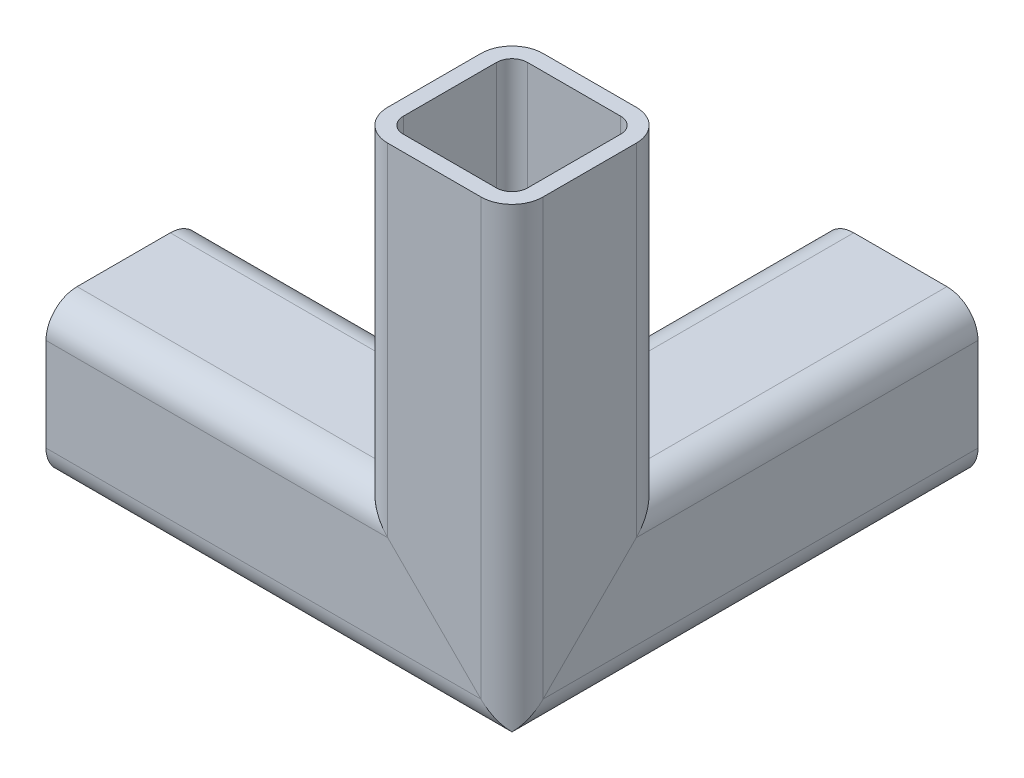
ISO-10303-21;
HEADER;
FILE_DESCRIPTION(('STEP AP214'),'2;1');
FILE_NAME('part.step','',(''),(''),'','','');
FILE_SCHEMA(('AUTOMOTIVE_DESIGN { 1 0 10303 214 1 1 1 1 }'));
ENDSEC;
DATA;
#1=APPLICATION_CONTEXT('core data for automotive mechanical design processes');
#2=APPLICATION_PROTOCOL_DEFINITION('international standard','automotive_design',2000,#1);
#3=PRODUCT_CONTEXT('',#1,'mechanical');
#4=PRODUCT('Part','Part','',(#3));
#5=PRODUCT_RELATED_PRODUCT_CATEGORY('part','',(#4));
#6=PRODUCT_DEFINITION_FORMATION('','',#4);
#7=PRODUCT_DEFINITION_CONTEXT('part definition',#1,'design');
#8=PRODUCT_DEFINITION('design','',#6,#7);
#9=PRODUCT_DEFINITION_SHAPE('','',#8);
#10=(LENGTH_UNIT() NAMED_UNIT(*) SI_UNIT(.MILLI.,.METRE.));
#11=(NAMED_UNIT(*) PLANE_ANGLE_UNIT() SI_UNIT($,.RADIAN.));
#12=(NAMED_UNIT(*) SI_UNIT($,.STERADIAN.) SOLID_ANGLE_UNIT());
#13=UNCERTAINTY_MEASURE_WITH_UNIT(LENGTH_MEASURE(1.E-05),#10,'distance_accuracy_value','');
#14=(GEOMETRIC_REPRESENTATION_CONTEXT(3) GLOBAL_UNCERTAINTY_ASSIGNED_CONTEXT((#13)) GLOBAL_UNIT_ASSIGNED_CONTEXT((#10,
#11,#12)) REPRESENTATION_CONTEXT('',''));
#15=CARTESIAN_POINT('',(0.,0.,0.));
#16=DIRECTION('',(0.,0.,1.));
#17=DIRECTION('',(1.,0.,0.));
#18=AXIS2_PLACEMENT_3D('',#15,#16,#17);
#19=CARTESIAN_POINT('',(0.,0.,0.));
#20=DIRECTION('',(0.,0.707106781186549,0.707106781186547));
#21=DIRECTION('',(0.,-0.707106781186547,0.707106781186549));
#22=AXIS2_PLACEMENT_3D('',#19,#20,#21);
#23=PLANE('',#22);
#24=CARTESIAN_POINT('',(-12.,12.,-12.));
#25=DIRECTION('',(0.,0.707106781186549,0.707106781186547));
#26=DIRECTION('',(0.,-0.707106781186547,0.707106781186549));
#27=AXIS2_PLACEMENT_3D('',#24,#25,#26);
#28=ELLIPSE('',#27,11.3137084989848,8.);
#29=CARTESIAN_POINT('',(-12.,20.,-20.));
#30=VERTEX_POINT('',#29);
#31=CARTESIAN_POINT('',(-17.6568542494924,17.6568542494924,-17.6568542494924));
#32=VERTEX_POINT('',#31);
#33=EDGE_CURVE('E266',#30,#32,#28,.T.);
#34=ORIENTED_EDGE('',*,*,#33,.T.);
#35=DIRECTION('',(0.577350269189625,-0.577350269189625,0.577350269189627));
#36=VECTOR('',#35,1.);
#37=CARTESIAN_POINT('',(0.,0.,0.));
#38=LINE('',#37,#36);
#39=CARTESIAN_POINT('',(-14.8284271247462,14.8284271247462,-14.8284271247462));
#40=VERTEX_POINT('',#39);
#41=EDGE_CURVE('E262',#32,#40,#38,.T.);
#42=ORIENTED_EDGE('',*,*,#41,.T.);
#43=CARTESIAN_POINT('',(-12.,12.,-12.));
#44=DIRECTION('',(0.,0.707106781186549,0.707106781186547));
#45=DIRECTION('',(0.,-0.707106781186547,0.707106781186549));
#46=AXIS2_PLACEMENT_3D('',#43,#44,#45);
#47=ELLIPSE('',#46,5.65685424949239,4.);
#48=CARTESIAN_POINT('',(-12.,16.,-16.));
#49=VERTEX_POINT('',#48);
#50=EDGE_CURVE('E249',#49,#40,#47,.T.);
#51=ORIENTED_EDGE('',*,*,#50,.F.);
#52=DIRECTION('',(-1.,0.,0.));
#53=VECTOR('',#52,1.);
#54=CARTESIAN_POINT('',(-12.,16.,-16.));
#55=LINE('',#54,#53);
#56=CARTESIAN_POINT('',(12.,16.,-16.));
#57=VERTEX_POINT('',#56);
#58=EDGE_CURVE('E200',#57,#49,#55,.T.);
#59=ORIENTED_EDGE('',*,*,#58,.F.);
#60=CARTESIAN_POINT('',(12.,12.,-12.));
#61=DIRECTION('',(0.,0.707106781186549,0.707106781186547));
#62=DIRECTION('',(0.,-0.707106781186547,0.707106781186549));
#63=AXIS2_PLACEMENT_3D('',#60,#61,#62);
#64=ELLIPSE('',#63,5.65685424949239,4.);
#65=CARTESIAN_POINT('',(16.,12.,-12.));
#66=VERTEX_POINT('',#65);
#67=EDGE_CURVE('E196',#66,#57,#64,.T.);
#68=ORIENTED_EDGE('',*,*,#67,.F.);
#69=DIRECTION('',(0.,0.707106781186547,-0.707106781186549));
#70=VECTOR('',#69,1.);
#71=CARTESIAN_POINT('',(16.,44.,-44.0000000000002));
#72=LINE('',#71,#70);
#73=CARTESIAN_POINT('',(16.,-12.,12.0000000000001));
#74=VERTEX_POINT('',#73);
#75=EDGE_CURVE('E193',#74,#66,#72,.T.);
#76=ORIENTED_EDGE('',*,*,#75,.F.);
#77=CARTESIAN_POINT('',(12.,-12.,12.0000000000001));
#78=DIRECTION('',(0.,0.707106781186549,0.707106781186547));
#79=DIRECTION('',(0.,-0.707106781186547,0.707106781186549));
#80=AXIS2_PLACEMENT_3D('',#77,#78,#79);
#81=ELLIPSE('',#80,5.65685424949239,4.);
#82=CARTESIAN_POINT('',(14.8284271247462,-14.8284271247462,14.8284271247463));
#83=VERTEX_POINT('',#82);
#84=EDGE_CURVE('E235',#83,#74,#81,.T.);
#85=ORIENTED_EDGE('',*,*,#84,.F.);
#86=CARTESIAN_POINT('',(17.6568542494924,-17.6568542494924,17.6568542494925));
#87=VERTEX_POINT('',#86);
#88=EDGE_CURVE('E265',#83,#87,#38,.T.);
#89=ORIENTED_EDGE('',*,*,#88,.T.);
#90=CARTESIAN_POINT('',(12.,-12.,12.0000000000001));
#91=DIRECTION('',(0.,0.707106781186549,0.707106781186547));
#92=DIRECTION('',(0.,-0.707106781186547,0.707106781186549));
#93=AXIS2_PLACEMENT_3D('',#90,#91,#92);
#94=ELLIPSE('',#93,11.3137084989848,8.);
#95=CARTESIAN_POINT('',(20.,-12.,12.0000000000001));
#96=VERTEX_POINT('',#95);
#97=EDGE_CURVE('E190',#87,#96,#94,.T.);
#98=ORIENTED_EDGE('',*,*,#97,.T.);
#99=DIRECTION('',(0.,0.707106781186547,-0.707106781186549));
#100=VECTOR('',#99,1.);
#101=CARTESIAN_POINT('',(20.,44.,-44.0000000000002));
#102=LINE('',#101,#100);
#103=CARTESIAN_POINT('',(20.,12.,-12.));
#104=VERTEX_POINT('',#103);
#105=EDGE_CURVE('E188',#96,#104,#102,.T.);
#106=ORIENTED_EDGE('',*,*,#105,.T.);
#107=CARTESIAN_POINT('',(12.,12.,-12.));
#108=DIRECTION('',(0.,0.707106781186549,0.707106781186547));
#109=DIRECTION('',(0.,-0.707106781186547,0.707106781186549));
#110=AXIS2_PLACEMENT_3D('',#107,#108,#109);
#111=ELLIPSE('',#110,11.3137084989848,8.);
#112=CARTESIAN_POINT('',(12.,20.,-20.));
#113=VERTEX_POINT('',#112);
#114=EDGE_CURVE('E172',#104,#113,#111,.T.);
#115=ORIENTED_EDGE('',*,*,#114,.T.);
#116=DIRECTION('',(-1.,0.,0.));
#117=VECTOR('',#116,1.);
#118=CARTESIAN_POINT('',(-12.,20.,-20.));
#119=LINE('',#118,#117);
#120=EDGE_CURVE('E180',#113,#30,#119,.T.);
#121=ORIENTED_EDGE('',*,*,#120,.T.);
#122=EDGE_LOOP('',(#34,#42,#51,#59,#68,#76,#85,#89,#98,#106,#115,#121));
#123=FACE_BOUND('',#122,.T.);
#124=ADVANCED_FACE('F81',(#123),#23,.T.);
#125=CARTESIAN_POINT('',(-20.,12.,-100.));
#126=DIRECTION('',(1.,0.,0.));
#127=DIRECTION('',(0.,0.,-1.));
#128=AXIS2_PLACEMENT_3D('',#125,#126,#127);
#129=PLANE('',#128);
#130=DIRECTION('',(0.,-1.,0.));
#131=VECTOR('',#130,1.);
#132=CARTESIAN_POINT('',(-20.,12.,-20.0000000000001));
#133=LINE('',#132,#131);
#134=CARTESIAN_POINT('',(-20.,12.,-20.));
#135=VERTEX_POINT('',#134);
#136=CARTESIAN_POINT('',(-20.,-12.,-20.));
#137=VERTEX_POINT('',#136);
#138=EDGE_CURVE('E14',#135,#137,#133,.T.);
#139=ORIENTED_EDGE('',*,*,#138,.F.);
#140=DIRECTION('',(0.,0.,1.));
#141=VECTOR('',#140,1.);
#142=CARTESIAN_POINT('',(-20.,12.,-100.));
#143=LINE('',#142,#141);
#144=CARTESIAN_POINT('',(-20.,12.,-100.));
#145=VERTEX_POINT('',#144);
#146=EDGE_CURVE('E85',#145,#135,#143,.T.);
#147=ORIENTED_EDGE('',*,*,#146,.F.);
#148=DIRECTION('',(0.,1.,0.));
#149=VECTOR('',#148,1.);
#150=CARTESIAN_POINT('',(-20.,12.,-100.));
#151=LINE('',#150,#149);
#152=CARTESIAN_POINT('',(-20.,-12.,-100.));
#153=VERTEX_POINT('',#152);
#154=EDGE_CURVE('E205',#153,#145,#151,.T.);
#155=ORIENTED_EDGE('',*,*,#154,.F.);
#156=DIRECTION('',(0.,0.,1.));
#157=VECTOR('',#156,1.);
#158=CARTESIAN_POINT('',(-20.,-12.,-100.));
#159=LINE('',#158,#157);
#160=EDGE_CURVE('E184',#153,#137,#159,.T.);
#161=ORIENTED_EDGE('',*,*,#160,.T.);
#162=EDGE_LOOP('',(#139,#147,#155,#161));
#163=FACE_BOUND('',#162,.T.);
#164=ADVANCED_FACE('F398',(#163),#129,.F.);
#165=CARTESIAN_POINT('',(12.,-12.,-100.));
#166=DIRECTION('',(0.,0.,1.));
#167=DIRECTION('',(1.,0.,0.));
#168=AXIS2_PLACEMENT_3D('',#165,#166,#167);
#169=CYLINDRICAL_SURFACE('',#168,4.);
#170=DIRECTION('',(0.,0.,1.));
#171=VECTOR('',#170,1.);
#172=CARTESIAN_POINT('',(12.,-16.,-100.));
#173=LINE('',#172,#171);
#174=CARTESIAN_POINT('',(12.,-16.,-100.));
#175=VERTEX_POINT('',#174);
#176=CARTESIAN_POINT('',(12.,-16.,12.0000000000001));
#177=VERTEX_POINT('',#176);
#178=EDGE_CURVE('E278',#175,#177,#173,.T.);
#179=ORIENTED_EDGE('',*,*,#178,.T.);
#180=CARTESIAN_POINT('',(12.,-12.,12.0000000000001));
#181=DIRECTION('',(-0.707106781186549,0.,0.707106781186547));
#182=DIRECTION('',(0.707106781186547,0.,0.707106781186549));
#183=AXIS2_PLACEMENT_3D('',#180,#181,#182);
#184=ELLIPSE('',#183,5.65685424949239,4.);
#185=EDGE_CURVE('E275',#177,#83,#184,.T.);
#186=ORIENTED_EDGE('',*,*,#185,.T.);
#187=ORIENTED_EDGE('',*,*,#84,.T.);
#188=DIRECTION('',(0.,0.,1.));
#189=VECTOR('',#188,1.);
#190=CARTESIAN_POINT('',(16.,-12.,-100.));
#191=LINE('',#190,#189);
#192=CARTESIAN_POINT('',(16.,-12.,-100.));
#193=VERTEX_POINT('',#192);
#194=EDGE_CURVE('E230',#193,#74,#191,.T.);
#195=ORIENTED_EDGE('',*,*,#194,.F.);
#196=CARTESIAN_POINT('',(12.,-12.,-100.));
#197=DIRECTION('',(0.,0.,-1.));
#198=DIRECTION('',(0.,-1.,0.));
#199=AXIS2_PLACEMENT_3D('',#196,#197,#198);
#200=CIRCLE('',#199,4.);
#201=EDGE_CURVE('E231',#193,#175,#200,.T.);
#202=ORIENTED_EDGE('',*,*,#201,.T.);
#203=EDGE_LOOP('',(#179,#186,#187,#195,#202));
#204=FACE_BOUND('',#203,.T.);
#205=ADVANCED_FACE('F378',(#204),#169,.F.);
#206=CARTESIAN_POINT('',(12.,-16.,-100.));
#207=DIRECTION('',(0.,1.,0.));
#208=DIRECTION('',(0.,0.,1.));
#209=AXIS2_PLACEMENT_3D('',#206,#207,#208);
#210=PLANE('',#209);
#211=DIRECTION('',(0.,0.,1.));
#212=VECTOR('',#211,1.);
#213=CARTESIAN_POINT('',(-12.,-16.,-100.));
#214=LINE('',#213,#212);
#215=CARTESIAN_POINT('',(-12.,-16.,-100.));
#216=VERTEX_POINT('',#215);
#217=CARTESIAN_POINT('',(-12.,-16.,-12.));
#218=VERTEX_POINT('',#217);
#219=EDGE_CURVE('E234',#216,#218,#214,.T.);
#220=ORIENTED_EDGE('',*,*,#219,.T.);
#221=DIRECTION('',(0.707106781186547,0.,0.707106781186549));
#222=VECTOR('',#221,1.);
#223=CARTESIAN_POINT('',(-44.0000000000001,-16.,-44.0000000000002));
#224=LINE('',#223,#222);
#225=EDGE_CURVE('E240',#218,#177,#224,.T.);
#226=ORIENTED_EDGE('',*,*,#225,.T.);
#227=ORIENTED_EDGE('',*,*,#178,.F.);
#228=DIRECTION('',(-1.,0.,0.));
#229=VECTOR('',#228,1.);
#230=CARTESIAN_POINT('',(12.,-16.,-100.));
#231=LINE('',#230,#229);
#232=EDGE_CURVE('E236',#175,#216,#231,.T.);
#233=ORIENTED_EDGE('',*,*,#232,.T.);
#234=EDGE_LOOP('',(#220,#226,#227,#233));
#235=FACE_BOUND('',#234,.T.);
#236=ADVANCED_FACE('F419',(#235),#210,.T.);
#237=CARTESIAN_POINT('',(-12.,-12.,-100.));
#238=DIRECTION('',(0.,0.,1.));
#239=DIRECTION('',(1.,0.,0.));
#240=AXIS2_PLACEMENT_3D('',#237,#238,#239);
#241=CYLINDRICAL_SURFACE('',#240,4.);
#242=DIRECTION('',(0.,0.,1.));
#243=VECTOR('',#242,1.);
#244=CARTESIAN_POINT('',(-16.,-12.,-100.));
#245=LINE('',#244,#243);
#246=CARTESIAN_POINT('',(-16.,-12.,-100.));
#247=VERTEX_POINT('',#246);
#248=CARTESIAN_POINT('',(-16.,-12.,-16.));
#249=VERTEX_POINT('',#248);
#250=EDGE_CURVE('E239',#247,#249,#245,.T.);
#251=ORIENTED_EDGE('',*,*,#250,.T.);
#252=CARTESIAN_POINT('',(-12.,-12.,-12.));
#253=DIRECTION('',(-0.707106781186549,0.,0.707106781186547));
#254=DIRECTION('',(0.707106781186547,0.,0.707106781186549));
#255=AXIS2_PLACEMENT_3D('',#252,#253,#254);
#256=ELLIPSE('',#255,5.65685424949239,4.);
#257=EDGE_CURVE('E245',#249,#218,#256,.T.);
#258=ORIENTED_EDGE('',*,*,#257,.T.);
#259=ORIENTED_EDGE('',*,*,#219,.F.);
#260=CARTESIAN_POINT('',(-12.,-12.,-100.));
#261=DIRECTION('',(0.,0.,-1.));
#262=DIRECTION('',(0.,-1.,0.));
#263=AXIS2_PLACEMENT_3D('',#260,#261,#262);
#264=CIRCLE('',#263,4.);
#265=EDGE_CURVE('E241',#216,#247,#264,.T.);
#266=ORIENTED_EDGE('',*,*,#265,.T.);
#267=EDGE_LOOP('',(#251,#258,#259,#266));
#268=FACE_BOUND('',#267,.T.);
#269=ADVANCED_FACE('F422',(#268),#241,.F.);
#270=CARTESIAN_POINT('',(-16.,12.,-100.));
#271=DIRECTION('',(1.,0.,0.));
#272=DIRECTION('',(0.,0.,-1.));
#273=AXIS2_PLACEMENT_3D('',#270,#271,#272);
#274=PLANE('',#273);
#275=DIRECTION('',(0.,0.,1.));
#276=VECTOR('',#275,1.);
#277=CARTESIAN_POINT('',(-16.,12.,-100.));
#278=LINE('',#277,#276);
#279=CARTESIAN_POINT('',(-16.,12.,-100.));
#280=VERTEX_POINT('',#279);
#281=CARTESIAN_POINT('',(-16.,12.,-16.));
#282=VERTEX_POINT('',#281);
#283=EDGE_CURVE('E244',#280,#282,#278,.T.);
#284=ORIENTED_EDGE('',*,*,#283,.T.);
#285=DIRECTION('',(0.,-1.,0.));
#286=VECTOR('',#285,1.);
#287=CARTESIAN_POINT('',(-16.,12.,-16.));
#288=LINE('',#287,#286);
#289=EDGE_CURVE('E250',#282,#249,#288,.T.);
#290=ORIENTED_EDGE('',*,*,#289,.T.);
#291=ORIENTED_EDGE('',*,*,#250,.F.);
#292=DIRECTION('',(0.,1.,0.));
#293=VECTOR('',#292,1.);
#294=CARTESIAN_POINT('',(-16.,12.,-100.));
#295=LINE('',#294,#293);
#296=EDGE_CURVE('E246',#247,#280,#295,.T.);
#297=ORIENTED_EDGE('',*,*,#296,.T.);
#298=EDGE_LOOP('',(#284,#290,#291,#297));
#299=FACE_BOUND('',#298,.T.);
#300=ADVANCED_FACE('F425',(#299),#274,.T.);
#301=CARTESIAN_POINT('',(-12.,12.,-100.));
#302=DIRECTION('',(0.,0.,1.));
#303=DIRECTION('',(1.,0.,0.));
#304=AXIS2_PLACEMENT_3D('',#301,#302,#303);
#305=CYLINDRICAL_SURFACE('',#304,4.);
#306=ORIENTED_EDGE('',*,*,#50,.T.);
#307=CARTESIAN_POINT('',(-12.,12.,-12.));
#308=DIRECTION('',(-0.707106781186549,0.,0.707106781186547));
#309=DIRECTION('',(0.707106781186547,0.,0.707106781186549));
#310=AXIS2_PLACEMENT_3D('',#307,#308,#309);
#311=ELLIPSE('',#310,5.65685424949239,4.);
#312=EDGE_CURVE('E255',#40,#282,#311,.T.);
#313=ORIENTED_EDGE('',*,*,#312,.T.);
#314=ORIENTED_EDGE('',*,*,#283,.F.);
#315=CARTESIAN_POINT('',(-12.,12.,-100.));
#316=DIRECTION('',(0.,0.,-1.));
#317=DIRECTION('',(0.,-1.,0.));
#318=AXIS2_PLACEMENT_3D('',#315,#316,#317);
#319=CIRCLE('',#318,4.);
#320=CARTESIAN_POINT('',(-12.,16.,-100.));
#321=VERTEX_POINT('',#320);
#322=EDGE_CURVE('E251',#280,#321,#319,.T.);
#323=ORIENTED_EDGE('',*,*,#322,.T.);
#324=DIRECTION('',(0.,0.,1.));
#325=VECTOR('',#324,1.);
#326=CARTESIAN_POINT('',(-12.,16.,-100.));
#327=LINE('',#326,#325);
#328=EDGE_CURVE('E254',#321,#49,#327,.T.);
#329=ORIENTED_EDGE('',*,*,#328,.T.);
#330=EDGE_LOOP('',(#306,#313,#314,#323,#329));
#331=FACE_BOUND('',#330,.T.);
#332=ADVANCED_FACE('F362',(#331),#305,.F.);
#333=CARTESIAN_POINT('',(-12.,-12.,-100.));
#334=DIRECTION('',(0.,0.,1.));
#335=DIRECTION('',(1.,0.,0.));
#336=AXIS2_PLACEMENT_3D('',#333,#334,#335);
#337=CYLINDRICAL_SURFACE('',#336,8.);
#338=CARTESIAN_POINT('',(-12.,-12.,-12.));
#339=DIRECTION('',(-0.707106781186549,0.,0.707106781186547));
#340=DIRECTION('',(0.707106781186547,0.,0.707106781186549));
#341=AXIS2_PLACEMENT_3D('',#338,#339,#340);
#342=ELLIPSE('',#341,11.3137084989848,8.);
#343=CARTESIAN_POINT('',(-12.,-20.,-12.0000000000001));
#344=VERTEX_POINT('',#343);
#345=EDGE_CURVE('E208',#137,#344,#342,.T.);
#346=ORIENTED_EDGE('',*,*,#345,.F.);
#347=ORIENTED_EDGE('',*,*,#160,.F.);
#348=CARTESIAN_POINT('',(-12.,-12.,-100.));
#349=DIRECTION('',(0.,0.,-1.));
#350=DIRECTION('',(0.,-1.,0.));
#351=AXIS2_PLACEMENT_3D('',#348,#349,#350);
#352=CIRCLE('',#351,8.);
#353=CARTESIAN_POINT('',(-12.,-20.,-100.));
#354=VERTEX_POINT('',#353);
#355=EDGE_CURVE('E209',#354,#153,#352,.T.);
#356=ORIENTED_EDGE('',*,*,#355,.F.);
#357=DIRECTION('',(0.,0.,1.));
#358=VECTOR('',#357,1.);
#359=CARTESIAN_POINT('',(-12.,-20.,-100.));
#360=LINE('',#359,#358);
#361=EDGE_CURVE('E305',#354,#344,#360,.T.);
#362=ORIENTED_EDGE('',*,*,#361,.T.);
#363=EDGE_LOOP('',(#346,#347,#356,#362));
#364=FACE_BOUND('',#363,.T.);
#365=ADVANCED_FACE('F409',(#364),#337,.T.);
#366=CARTESIAN_POINT('',(12.,-20.,-100.));
#367=DIRECTION('',(0.,1.,0.));
#368=DIRECTION('',(0.,0.,1.));
#369=AXIS2_PLACEMENT_3D('',#366,#367,#368);
#370=PLANE('',#369);
#371=DIRECTION('',(0.707106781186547,0.,0.707106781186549));
#372=VECTOR('',#371,1.);
#373=CARTESIAN_POINT('',(-44.,-20.,-44.0000000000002));
#374=LINE('',#373,#372);
#375=CARTESIAN_POINT('',(12.,-20.,12.0000000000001));
#376=VERTEX_POINT('',#375);
#377=EDGE_CURVE('E282',#344,#376,#374,.T.);
#378=ORIENTED_EDGE('',*,*,#377,.F.);
#379=ORIENTED_EDGE('',*,*,#361,.F.);
#380=DIRECTION('',(-1.,0.,0.));
#381=VECTOR('',#380,1.);
#382=CARTESIAN_POINT('',(12.,-20.,-100.));
#383=LINE('',#382,#381);
#384=CARTESIAN_POINT('',(12.,-20.,-100.));
#385=VERTEX_POINT('',#384);
#386=EDGE_CURVE('E212',#385,#354,#383,.T.);
#387=ORIENTED_EDGE('',*,*,#386,.F.);
#388=DIRECTION('',(0.,0.,1.));
#389=VECTOR('',#388,1.);
#390=CARTESIAN_POINT('',(12.,-20.,-100.));
#391=LINE('',#390,#389);
#392=EDGE_CURVE('E307',#385,#376,#391,.T.);
#393=ORIENTED_EDGE('',*,*,#392,.T.);
#394=EDGE_LOOP('',(#378,#379,#387,#393));
#395=FACE_BOUND('',#394,.T.);
#396=ADVANCED_FACE('F384',(#395),#370,.F.);
#397=CARTESIAN_POINT('',(12.,-12.,-100.));
#398=DIRECTION('',(0.,0.,1.));
#399=DIRECTION('',(1.,0.,0.));
#400=AXIS2_PLACEMENT_3D('',#397,#398,#399);
#401=CYLINDRICAL_SURFACE('',#400,8.);
#402=CARTESIAN_POINT('',(12.,-12.,12.0000000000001));
#403=DIRECTION('',(-0.707106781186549,0.,0.707106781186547));
#404=DIRECTION('',(0.707106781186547,0.,0.707106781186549));
#405=AXIS2_PLACEMENT_3D('',#402,#403,#404);
#406=ELLIPSE('',#405,11.3137084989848,8.);
#407=EDGE_CURVE('E279',#376,#87,#406,.T.);
#408=ORIENTED_EDGE('',*,*,#407,.F.);
#409=ORIENTED_EDGE('',*,*,#392,.F.);
#410=CARTESIAN_POINT('',(12.,-12.,-100.));
#411=DIRECTION('',(0.,0.,-1.));
#412=DIRECTION('',(0.,-1.,0.));
#413=AXIS2_PLACEMENT_3D('',#410,#411,#412);
#414=CIRCLE('',#413,8.);
#415=CARTESIAN_POINT('',(20.,-12.,-100.));
#416=VERTEX_POINT('',#415);
#417=EDGE_CURVE('E215',#416,#385,#414,.T.);
#418=ORIENTED_EDGE('',*,*,#417,.F.);
#419=DIRECTION('',(0.,0.,1.));
#420=VECTOR('',#419,1.);
#421=CARTESIAN_POINT('',(20.,-12.,-100.));
#422=LINE('',#421,#420);
#423=EDGE_CURVE('E309',#416,#96,#422,.T.);
#424=ORIENTED_EDGE('',*,*,#423,.T.);
#425=ORIENTED_EDGE('',*,*,#97,.F.);
#426=EDGE_LOOP('',(#408,#409,#418,#424,#425));
#427=FACE_BOUND('',#426,.T.);
#428=ADVANCED_FACE('F383',(#427),#401,.T.);
#429=CARTESIAN_POINT('',(-12.,12.,-100.));
#430=DIRECTION('',(0.,0.,1.));
#431=DIRECTION('',(1.,0.,0.));
#432=AXIS2_PLACEMENT_3D('',#429,#430,#431);
#433=CYLINDRICAL_SURFACE('',#432,8.);
#434=CARTESIAN_POINT('',(-12.,12.,-12.));
#435=DIRECTION('',(-0.707106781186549,0.,0.707106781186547));
#436=DIRECTION('',(0.707106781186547,0.,0.707106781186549));
#437=AXIS2_PLACEMENT_3D('',#434,#435,#436);
#438=ELLIPSE('',#437,11.3137084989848,8.);
#439=EDGE_CURVE('E91',#32,#135,#438,.T.);
#440=ORIENTED_EDGE('',*,*,#439,.F.);
#441=ORIENTED_EDGE('',*,*,#33,.F.);
#442=DIRECTION('',(0.,0.,1.));
#443=VECTOR('',#442,1.);
#444=CARTESIAN_POINT('',(-12.,20.,-100.));
#445=LINE('',#444,#443);
#446=CARTESIAN_POINT('',(-12.,20.,-100.));
#447=VERTEX_POINT('',#446);
#448=EDGE_CURVE('E100',#447,#30,#445,.T.);
#449=ORIENTED_EDGE('',*,*,#448,.F.);
#450=CARTESIAN_POINT('',(-12.,12.,-100.));
#451=DIRECTION('',(0.,0.,-1.));
#452=DIRECTION('',(0.,-1.,0.));
#453=AXIS2_PLACEMENT_3D('',#450,#451,#452);
#454=CIRCLE('',#453,8.);
#455=EDGE_CURVE('E224',#145,#447,#454,.T.);
#456=ORIENTED_EDGE('',*,*,#455,.F.);
#457=ORIENTED_EDGE('',*,*,#146,.T.);
#458=EDGE_LOOP('',(#440,#441,#449,#456,#457));
#459=FACE_BOUND('',#458,.T.);
#460=ADVANCED_FACE('F405',(#459),#433,.T.);
#461=CARTESIAN_POINT('',(16.,-12.,-100.));
#462=DIRECTION('',(-1.,0.,0.));
#463=DIRECTION('',(0.,0.,1.));
#464=AXIS2_PLACEMENT_3D('',#461,#462,#463);
#465=PLANE('',#464);
#466=DIRECTION('',(0.,0.,1.));
#467=VECTOR('',#466,1.);
#468=CARTESIAN_POINT('',(16.,12.,-100.));
#469=LINE('',#468,#467);
#470=CARTESIAN_POINT('',(16.,12.,-100.));
#471=VERTEX_POINT('',#470);
#472=EDGE_CURVE('E199',#471,#66,#469,.T.);
#473=ORIENTED_EDGE('',*,*,#472,.F.);
#474=DIRECTION('',(0.,-1.,0.));
#475=VECTOR('',#474,1.);
#476=CARTESIAN_POINT('',(16.,-12.,-100.));
#477=LINE('',#476,#475);
#478=EDGE_CURVE('E227',#471,#193,#477,.T.);
#479=ORIENTED_EDGE('',*,*,#478,.T.);
#480=ORIENTED_EDGE('',*,*,#194,.T.);
#481=ORIENTED_EDGE('',*,*,#75,.T.);
#482=EDGE_LOOP('',(#473,#479,#480,#481));
#483=FACE_BOUND('',#482,.T.);
#484=ADVANCED_FACE('F330',(#483),#465,.T.);
#485=CARTESIAN_POINT('',(-12.,16.,-100.));
#486=DIRECTION('',(0.,-1.,0.));
#487=DIRECTION('',(0.,0.,-1.));
#488=AXIS2_PLACEMENT_3D('',#485,#486,#487);
#489=PLANE('',#488);
#490=ORIENTED_EDGE('',*,*,#328,.F.);
#491=DIRECTION('',(1.,0.,0.));
#492=VECTOR('',#491,1.);
#493=CARTESIAN_POINT('',(-12.,16.,-100.));
#494=LINE('',#493,#492);
#495=CARTESIAN_POINT('',(12.,16.,-100.));
#496=VERTEX_POINT('',#495);
#497=EDGE_CURVE('E256',#321,#496,#494,.T.);
#498=ORIENTED_EDGE('',*,*,#497,.T.);
#499=DIRECTION('',(0.,0.,1.));
#500=VECTOR('',#499,1.);
#501=CARTESIAN_POINT('',(12.,16.,-100.));
#502=LINE('',#501,#500);
#503=EDGE_CURVE('E203',#496,#57,#502,.T.);
#504=ORIENTED_EDGE('',*,*,#503,.T.);
#505=ORIENTED_EDGE('',*,*,#58,.T.);
#506=EDGE_LOOP('',(#490,#498,#504,#505));
#507=FACE_BOUND('',#506,.T.);
#508=ADVANCED_FACE('F368',(#507),#489,.T.);
#509=CARTESIAN_POINT('',(12.,12.,-100.));
#510=DIRECTION('',(0.,0.,1.));
#511=DIRECTION('',(1.,0.,0.));
#512=AXIS2_PLACEMENT_3D('',#509,#510,#511);
#513=CYLINDRICAL_SURFACE('',#512,4.);
#514=ORIENTED_EDGE('',*,*,#503,.F.);
#515=CARTESIAN_POINT('',(12.,12.,-100.));
#516=DIRECTION('',(0.,0.,-1.));
#517=DIRECTION('',(0.,-1.,0.));
#518=AXIS2_PLACEMENT_3D('',#515,#516,#517);
#519=CIRCLE('',#518,4.);
#520=EDGE_CURVE('E202',#496,#471,#519,.T.);
#521=ORIENTED_EDGE('',*,*,#520,.T.);
#522=ORIENTED_EDGE('',*,*,#472,.T.);
#523=ORIENTED_EDGE('',*,*,#67,.T.);
#524=EDGE_LOOP('',(#514,#521,#522,#523));
#525=FACE_BOUND('',#524,.T.);
#526=ADVANCED_FACE('F371',(#525),#513,.F.);
#527=CARTESIAN_POINT('',(20.,-12.,-100.));
#528=DIRECTION('',(-1.,0.,0.));
#529=DIRECTION('',(0.,0.,1.));
#530=AXIS2_PLACEMENT_3D('',#527,#528,#529);
#531=PLANE('',#530);
#532=ORIENTED_EDGE('',*,*,#423,.F.);
#533=DIRECTION('',(0.,-1.,0.));
#534=VECTOR('',#533,1.);
#535=CARTESIAN_POINT('',(20.,-12.,-100.));
#536=LINE('',#535,#534);
#537=CARTESIAN_POINT('',(20.,12.,-100.));
#538=VERTEX_POINT('',#537);
#539=EDGE_CURVE('E218',#538,#416,#536,.T.);
#540=ORIENTED_EDGE('',*,*,#539,.F.);
#541=DIRECTION('',(0.,0.,1.));
#542=VECTOR('',#541,1.);
#543=CARTESIAN_POINT('',(20.,12.,-100.));
#544=LINE('',#543,#542);
#545=EDGE_CURVE('E177',#538,#104,#544,.T.);
#546=ORIENTED_EDGE('',*,*,#545,.T.);
#547=ORIENTED_EDGE('',*,*,#105,.F.);
#548=EDGE_LOOP('',(#532,#540,#546,#547));
#549=FACE_BOUND('',#548,.T.);
#550=ADVANCED_FACE('F388',(#549),#531,.F.);
#551=CARTESIAN_POINT('',(12.,12.,-100.));
#552=DIRECTION('',(0.,0.,1.));
#553=DIRECTION('',(1.,0.,0.));
#554=AXIS2_PLACEMENT_3D('',#551,#552,#553);
#555=CYLINDRICAL_SURFACE('',#554,8.);
#556=ORIENTED_EDGE('',*,*,#545,.F.);
#557=CARTESIAN_POINT('',(12.,12.,-100.));
#558=DIRECTION('',(0.,0.,-1.));
#559=DIRECTION('',(0.,-1.,0.));
#560=AXIS2_PLACEMENT_3D('',#557,#558,#559);
#561=CIRCLE('',#560,8.);
#562=CARTESIAN_POINT('',(12.,20.,-100.));
#563=VERTEX_POINT('',#562);
#564=EDGE_CURVE('E175',#563,#538,#561,.T.);
#565=ORIENTED_EDGE('',*,*,#564,.F.);
#566=DIRECTION('',(0.,0.,1.));
#567=VECTOR('',#566,1.);
#568=CARTESIAN_POINT('',(12.,20.,-100.));
#569=LINE('',#568,#567);
#570=EDGE_CURVE('E169',#563,#113,#569,.T.);
#571=ORIENTED_EDGE('',*,*,#570,.T.);
#572=ORIENTED_EDGE('',*,*,#114,.F.);
#573=EDGE_LOOP('',(#556,#565,#571,#572));
#574=FACE_BOUND('',#573,.T.);
#575=ADVANCED_FACE('F170',(#574),#555,.T.);
#576=CARTESIAN_POINT('',(-12.,20.,-100.));
#577=DIRECTION('',(0.,-1.,0.));
#578=DIRECTION('',(0.,0.,-1.));
#579=AXIS2_PLACEMENT_3D('',#576,#577,#578);
#580=PLANE('',#579);
#581=DIRECTION('',(1.,0.,0.));
#582=VECTOR('',#581,1.);
#583=CARTESIAN_POINT('',(-12.,20.,-100.));
#584=LINE('',#583,#582);
#585=EDGE_CURVE('E222',#447,#563,#584,.T.);
#586=ORIENTED_EDGE('',*,*,#585,.F.);
#587=ORIENTED_EDGE('',*,*,#448,.T.);
#588=ORIENTED_EDGE('',*,*,#120,.F.);
#589=ORIENTED_EDGE('',*,*,#570,.F.);
#590=EDGE_LOOP('',(#586,#587,#588,#589));
#591=FACE_BOUND('',#590,.T.);
#592=ADVANCED_FACE('F181',(#591),#580,.F.);
#593=CARTESIAN_POINT('',(-12.,12.,-100.));
#594=DIRECTION('',(0.,0.,-1.));
#595=DIRECTION('',(0.,-1.,0.));
#596=AXIS2_PLACEMENT_3D('',#593,#594,#595);
#597=PLANE('',#596);
#598=ORIENTED_EDGE('',*,*,#520,.F.);
#599=ORIENTED_EDGE('',*,*,#497,.F.);
#600=ORIENTED_EDGE('',*,*,#322,.F.);
#601=ORIENTED_EDGE('',*,*,#296,.F.);
#602=ORIENTED_EDGE('',*,*,#265,.F.);
#603=ORIENTED_EDGE('',*,*,#232,.F.);
#604=ORIENTED_EDGE('',*,*,#201,.F.);
#605=ORIENTED_EDGE('',*,*,#478,.F.);
#606=EDGE_LOOP('',(#598,#599,#600,#601,#602,#603,#604,#605));
#607=FACE_BOUND('',#606,.T.);
#608=ORIENTED_EDGE('',*,*,#455,.T.);
#609=ORIENTED_EDGE('',*,*,#585,.T.);
#610=ORIENTED_EDGE('',*,*,#564,.T.);
#611=ORIENTED_EDGE('',*,*,#539,.T.);
#612=ORIENTED_EDGE('',*,*,#417,.T.);
#613=ORIENTED_EDGE('',*,*,#386,.T.);
#614=ORIENTED_EDGE('',*,*,#355,.T.);
#615=ORIENTED_EDGE('',*,*,#154,.T.);
#616=EDGE_LOOP('',(#608,#609,#610,#611,#612,#613,#614,#615));
#617=FACE_BOUND('',#616,.T.);
#618=ADVANCED_FACE('F373',(#607,#617),#597,.T.);
#619=CARTESIAN_POINT('',(0.,0.,0.));
#620=DIRECTION('',(-0.707106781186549,0.,0.707106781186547));
#621=DIRECTION('',(0.707106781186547,0.,0.707106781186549));
#622=AXIS2_PLACEMENT_3D('',#619,#620,#621);
#623=PLANE('',#622);
#624=ORIENTED_EDGE('',*,*,#345,.T.);
#625=ORIENTED_EDGE('',*,*,#377,.T.);
#626=ORIENTED_EDGE('',*,*,#407,.T.);
#627=ORIENTED_EDGE('',*,*,#88,.F.);
#628=ORIENTED_EDGE('',*,*,#185,.F.);
#629=ORIENTED_EDGE('',*,*,#225,.F.);
#630=ORIENTED_EDGE('',*,*,#257,.F.);
#631=ORIENTED_EDGE('',*,*,#289,.F.);
#632=ORIENTED_EDGE('',*,*,#312,.F.);
#633=ORIENTED_EDGE('',*,*,#41,.F.);
#634=ORIENTED_EDGE('',*,*,#439,.T.);
#635=ORIENTED_EDGE('',*,*,#138,.T.);
#636=EDGE_LOOP('',(#624,#625,#626,#627,#628,#629,#630,#631,#632,#633,#634,#635));
#637=FACE_BOUND('',#636,.T.);
#638=ADVANCED_FACE('F83',(#637),#623,.T.);
#639=CLOSED_SHELL('',(#124,#164,#205,#236,#269,#300,#332,#365,#396,#428,#460,#484,#508,#526,
#550,#575,#592,#618,#638));
#640=MANIFOLD_SOLID_BREP('B2',#639);
#641=CARTESIAN_POINT('',(0.,12.,12.));
#642=DIRECTION('',(-1.,0.,0.));
#643=DIRECTION('',(0.,0.,1.));
#644=AXIS2_PLACEMENT_3D('',#641,#642,#643);
#645=CYLINDRICAL_SURFACE('',#644,8.);
#646=CARTESIAN_POINT('',(-12.,12.,12.));
#647=DIRECTION('',(0.707106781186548,0.707106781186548,0.));
#648=DIRECTION('',(-0.707106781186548,0.707106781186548,0.));
#649=AXIS2_PLACEMENT_3D('',#646,#647,#648);
#650=ELLIPSE('',#649,11.3137084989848,8.);
#651=CARTESIAN_POINT('',(-20.,20.,12.));
#652=VERTEX_POINT('',#651);
#653=CARTESIAN_POINT('',(-11.9999999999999,12.,20.));
#654=VERTEX_POINT('',#653);
#655=EDGE_CURVE('E655',#652,#654,#650,.T.);
#656=ORIENTED_EDGE('',*,*,#655,.F.);
#657=DIRECTION('',(-1.,0.,0.));
#658=VECTOR('',#657,1.);
#659=CARTESIAN_POINT('',(0.,20.,12.));
#660=LINE('',#659,#658);
#661=CARTESIAN_POINT('',(-100.,20.,12.));
#662=VERTEX_POINT('',#661);
#663=EDGE_CURVE('E710',#652,#662,#660,.T.);
#664=ORIENTED_EDGE('',*,*,#663,.T.);
#665=CARTESIAN_POINT('',(-100.,12.,12.));
#666=DIRECTION('',(1.,0.,0.));
#667=DIRECTION('',(0.,0.,-1.));
#668=AXIS2_PLACEMENT_3D('',#665,#666,#667);
#669=CIRCLE('',#668,8.);
#670=CARTESIAN_POINT('',(-100.,12.,20.));
#671=VERTEX_POINT('',#670);
#672=EDGE_CURVE('E688',#662,#671,#669,.T.);
#673=ORIENTED_EDGE('',*,*,#672,.T.);
#674=DIRECTION('',(-1.,0.,0.));
#675=VECTOR('',#674,1.);
#676=CARTESIAN_POINT('',(0.,12.,20.));
#677=LINE('',#676,#675);
#678=EDGE_CURVE('E684',#654,#671,#677,.T.);
#679=ORIENTED_EDGE('',*,*,#678,.F.);
#680=EDGE_LOOP('',(#656,#664,#673,#679));
#681=FACE_BOUND('',#680,.T.);
#682=ADVANCED_FACE('F585',(#681),#645,.T.);
#683=CARTESIAN_POINT('',(0.,12.,20.));
#684=DIRECTION('',(0.,0.,-1.));
#685=DIRECTION('',(-1.,0.,0.));
#686=AXIS2_PLACEMENT_3D('',#683,#684,#685);
#687=PLANE('',#686);
#688=DIRECTION('',(0.707106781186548,-0.707106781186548,0.));
#689=VECTOR('',#688,1.);
#690=CARTESIAN_POINT('',(-5.99999999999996,6.,20.));
#691=LINE('',#690,#689);
#692=CARTESIAN_POINT('',(12.,-12.,20.));
#693=VERTEX_POINT('',#692);
#694=EDGE_CURVE('E650',#654,#693,#691,.T.);
#695=ORIENTED_EDGE('',*,*,#694,.F.);
#696=ORIENTED_EDGE('',*,*,#678,.T.);
#697=DIRECTION('',(0.,-1.,0.));
#698=VECTOR('',#697,1.);
#699=CARTESIAN_POINT('',(-100.,12.,20.));
#700=LINE('',#699,#698);
#701=CARTESIAN_POINT('',(-100.,-12.,20.));
#702=VERTEX_POINT('',#701);
#703=EDGE_CURVE('E687',#671,#702,#700,.T.);
#704=ORIENTED_EDGE('',*,*,#703,.T.);
#705=DIRECTION('',(-1.,0.,0.));
#706=VECTOR('',#705,1.);
#707=CARTESIAN_POINT('',(0.,-12.,20.));
#708=LINE('',#707,#706);
#709=EDGE_CURVE('E689',#693,#702,#708,.T.);
#710=ORIENTED_EDGE('',*,*,#709,.F.);
#711=EDGE_LOOP('',(#695,#696,#704,#710));
#712=FACE_BOUND('',#711,.T.);
#713=ADVANCED_FACE('F844',(#712),#687,.F.);
#714=CARTESIAN_POINT('',(0.,-12.,12.));
#715=DIRECTION('',(-1.,0.,0.));
#716=DIRECTION('',(0.,0.,1.));
#717=AXIS2_PLACEMENT_3D('',#714,#715,#716);
#718=CYLINDRICAL_SURFACE('',#717,8.);
#719=DIRECTION('',(-1.,0.,0.));
#720=VECTOR('',#719,1.);
#721=CARTESIAN_POINT('',(0.,-20.,12.));
#722=LINE('',#721,#720);
#723=CARTESIAN_POINT('',(12.,-20.,12.));
#724=VERTEX_POINT('',#723);
#725=CARTESIAN_POINT('',(-100.,-20.,12.));
#726=VERTEX_POINT('',#725);
#727=EDGE_CURVE('E643',#724,#726,#722,.T.);
#728=ORIENTED_EDGE('',*,*,#727,.F.);
#729=CARTESIAN_POINT('',(12.,-12.,12.));
#730=DIRECTION('',(-0.707106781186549,0.,0.707106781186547));
#731=DIRECTION('',(-0.707106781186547,0.,-0.707106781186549));
#732=AXIS2_PLACEMENT_3D('',#729,#730,#731);
#733=ELLIPSE('',#732,11.3137084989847,8.);
#734=CARTESIAN_POINT('',(17.6568542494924,-17.6568542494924,17.6568542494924));
#735=VERTEX_POINT('',#734);
#736=EDGE_CURVE('E594',#724,#735,#733,.T.);
#737=ORIENTED_EDGE('',*,*,#736,.T.);
#738=CARTESIAN_POINT('',(12.0000000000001,-12.,12.));
#739=DIRECTION('',(0.707106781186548,0.707106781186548,0.));
#740=DIRECTION('',(-0.707106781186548,0.707106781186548,0.));
#741=AXIS2_PLACEMENT_3D('',#738,#739,#740);
#742=ELLIPSE('',#741,11.3137084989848,8.);
#743=EDGE_CURVE('E639',#693,#735,#742,.T.);
#744=ORIENTED_EDGE('',*,*,#743,.F.);
#745=ORIENTED_EDGE('',*,*,#709,.T.);
#746=CARTESIAN_POINT('',(-100.,-12.,12.));
#747=DIRECTION('',(1.,0.,0.));
#748=DIRECTION('',(0.,0.,-1.));
#749=AXIS2_PLACEMENT_3D('',#746,#747,#748);
#750=CIRCLE('',#749,8.);
#751=EDGE_CURVE('E691',#702,#726,#750,.T.);
#752=ORIENTED_EDGE('',*,*,#751,.T.);
#753=EDGE_LOOP('',(#728,#737,#744,#745,#752));
#754=FACE_BOUND('',#753,.T.);
#755=ADVANCED_FACE('F636',(#754),#718,.T.);
#756=CARTESIAN_POINT('',(0.,-20.,-12.));
#757=DIRECTION('',(0.,1.,0.));
#758=DIRECTION('',(0.,0.,1.));
#759=AXIS2_PLACEMENT_3D('',#756,#757,#758);
#760=PLANE('',#759);
#761=DIRECTION('',(-1.,0.,0.));
#762=VECTOR('',#761,1.);
#763=CARTESIAN_POINT('',(0.,-20.,-12.));
#764=LINE('',#763,#762);
#765=CARTESIAN_POINT('',(-11.9999999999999,-20.,-12.));
#766=VERTEX_POINT('',#765);
#767=CARTESIAN_POINT('',(-100.,-20.,-12.));
#768=VERTEX_POINT('',#767);
#769=EDGE_CURVE('E694',#766,#768,#764,.T.);
#770=ORIENTED_EDGE('',*,*,#769,.F.);
#771=DIRECTION('',(0.707106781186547,0.,0.707106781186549));
#772=VECTOR('',#771,1.);
#773=CARTESIAN_POINT('',(-5.99999999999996,-20.,-6.00000000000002));
#774=LINE('',#773,#772);
#775=EDGE_CURVE('E644',#766,#724,#774,.T.);
#776=ORIENTED_EDGE('',*,*,#775,.T.);
#777=ORIENTED_EDGE('',*,*,#727,.T.);
#778=DIRECTION('',(0.,0.,-1.));
#779=VECTOR('',#778,1.);
#780=CARTESIAN_POINT('',(-100.,-20.,-12.));
#781=LINE('',#780,#779);
#782=EDGE_CURVE('E693',#726,#768,#781,.T.);
#783=ORIENTED_EDGE('',*,*,#782,.T.);
#784=EDGE_LOOP('',(#770,#776,#777,#783));
#785=FACE_BOUND('',#784,.T.);
#786=ADVANCED_FACE('F824',(#785),#760,.F.);
#787=CARTESIAN_POINT('',(0.,-12.,-12.));
#788=DIRECTION('',(-1.,0.,0.));
#789=DIRECTION('',(0.,0.,1.));
#790=AXIS2_PLACEMENT_3D('',#787,#788,#789);
#791=CYLINDRICAL_SURFACE('',#790,8.);
#792=DIRECTION('',(-1.,0.,0.));
#793=VECTOR('',#792,1.);
#794=CARTESIAN_POINT('',(0.,-12.,-20.));
#795=LINE('',#794,#793);
#796=CARTESIAN_POINT('',(-19.9999999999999,-12.,-20.));
#797=VERTEX_POINT('',#796);
#798=CARTESIAN_POINT('',(-100.,-12.,-20.));
#799=VERTEX_POINT('',#798);
#800=EDGE_CURVE('E698',#797,#799,#795,.T.);
#801=ORIENTED_EDGE('',*,*,#800,.F.);
#802=CARTESIAN_POINT('',(-11.9999999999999,-12.,-12.));
#803=DIRECTION('',(-0.707106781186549,0.,0.707106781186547));
#804=DIRECTION('',(-0.707106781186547,0.,-0.707106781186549));
#805=AXIS2_PLACEMENT_3D('',#802,#803,#804);
#806=ELLIPSE('',#805,11.3137084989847,8.);
#807=EDGE_CURVE('E813',#797,#766,#806,.T.);
#808=ORIENTED_EDGE('',*,*,#807,.T.);
#809=ORIENTED_EDGE('',*,*,#769,.T.);
#810=CARTESIAN_POINT('',(-100.,-12.,-12.));
#811=DIRECTION('',(1.,0.,0.));
#812=DIRECTION('',(0.,0.,-1.));
#813=AXIS2_PLACEMENT_3D('',#810,#811,#812);
#814=CIRCLE('',#813,8.);
#815=EDGE_CURVE('E697',#768,#799,#814,.T.);
#816=ORIENTED_EDGE('',*,*,#815,.T.);
#817=EDGE_LOOP('',(#801,#808,#809,#816));
#818=FACE_BOUND('',#817,.T.);
#819=ADVANCED_FACE('F819',(#818),#791,.T.);
#820=CARTESIAN_POINT('',(0.,-12.,-20.));
#821=DIRECTION('',(0.,0.,1.));
#822=DIRECTION('',(1.,0.,0.));
#823=AXIS2_PLACEMENT_3D('',#820,#821,#822);
#824=PLANE('',#823);
#825=DIRECTION('',(-1.,0.,0.));
#826=VECTOR('',#825,1.);
#827=CARTESIAN_POINT('',(0.,12.,-20.));
#828=LINE('',#827,#826);
#829=CARTESIAN_POINT('',(-19.9999999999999,12.,-20.));
#830=VERTEX_POINT('',#829);
#831=CARTESIAN_POINT('',(-100.,12.,-20.));
#832=VERTEX_POINT('',#831);
#833=EDGE_CURVE('E702',#830,#832,#828,.T.);
#834=ORIENTED_EDGE('',*,*,#833,.F.);
#835=DIRECTION('',(0.,-1.,0.));
#836=VECTOR('',#835,1.);
#837=CARTESIAN_POINT('',(-19.9999999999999,-12.,-20.));
#838=LINE('',#837,#836);
#839=EDGE_CURVE('E603',#830,#797,#838,.T.);
#840=ORIENTED_EDGE('',*,*,#839,.T.);
#841=ORIENTED_EDGE('',*,*,#800,.T.);
#842=DIRECTION('',(0.,1.,0.));
#843=VECTOR('',#842,1.);
#844=CARTESIAN_POINT('',(-100.,-12.,-20.));
#845=LINE('',#844,#843);
#846=EDGE_CURVE('E701',#799,#832,#845,.T.);
#847=ORIENTED_EDGE('',*,*,#846,.T.);
#848=EDGE_LOOP('',(#834,#840,#841,#847));
#849=FACE_BOUND('',#848,.T.);
#850=ADVANCED_FACE('F902',(#849),#824,.F.);
#851=CARTESIAN_POINT('',(0.,12.,-12.));
#852=DIRECTION('',(-1.,0.,0.));
#853=DIRECTION('',(0.,0.,1.));
#854=AXIS2_PLACEMENT_3D('',#851,#852,#853);
#855=CYLINDRICAL_SURFACE('',#854,8.);
#856=CARTESIAN_POINT('',(-11.9999999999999,12.,-12.));
#857=DIRECTION('',(0.707106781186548,0.707106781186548,0.));
#858=DIRECTION('',(-0.707106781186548,0.707106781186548,0.));
#859=AXIS2_PLACEMENT_3D('',#856,#857,#858);
#860=ELLIPSE('',#859,11.3137084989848,8.);
#861=CARTESIAN_POINT('',(-17.6568542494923,17.6568542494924,-17.6568542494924));
#862=VERTEX_POINT('',#861);
#863=CARTESIAN_POINT('',(-20.,20.,-12.));
#864=VERTEX_POINT('',#863);
#865=EDGE_CURVE('E651',#862,#864,#860,.T.);
#866=ORIENTED_EDGE('',*,*,#865,.F.);
#867=CARTESIAN_POINT('',(-11.9999999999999,12.,-12.));
#868=DIRECTION('',(-0.707106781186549,0.,0.707106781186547));
#869=DIRECTION('',(-0.707106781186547,0.,-0.707106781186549));
#870=AXIS2_PLACEMENT_3D('',#867,#868,#869);
#871=ELLIPSE('',#870,11.3137084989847,8.);
#872=EDGE_CURVE('E878',#862,#830,#871,.T.);
#873=ORIENTED_EDGE('',*,*,#872,.T.);
#874=ORIENTED_EDGE('',*,*,#833,.T.);
#875=CARTESIAN_POINT('',(-100.,12.,-12.));
#876=DIRECTION('',(1.,0.,0.));
#877=DIRECTION('',(0.,0.,-1.));
#878=AXIS2_PLACEMENT_3D('',#875,#876,#877);
#879=CIRCLE('',#878,8.);
#880=CARTESIAN_POINT('',(-100.,20.,-12.));
#881=VERTEX_POINT('',#880);
#882=EDGE_CURVE('E664',#832,#881,#879,.T.);
#883=ORIENTED_EDGE('',*,*,#882,.T.);
#884=DIRECTION('',(-1.,0.,0.));
#885=VECTOR('',#884,1.);
#886=CARTESIAN_POINT('',(0.,20.,-12.));
#887=LINE('',#886,#885);
#888=EDGE_CURVE('E705',#864,#881,#887,.T.);
#889=ORIENTED_EDGE('',*,*,#888,.F.);
#890=EDGE_LOOP('',(#866,#873,#874,#883,#889));
#891=FACE_BOUND('',#890,.T.);
#892=ADVANCED_FACE('F887',(#891),#855,.T.);
#893=CARTESIAN_POINT('',(0.,-12.,12.));
#894=DIRECTION('',(-1.,0.,0.));
#895=DIRECTION('',(0.,0.,1.));
#896=AXIS2_PLACEMENT_3D('',#893,#894,#895);
#897=CYLINDRICAL_SURFACE('',#896,4.);
#898=CARTESIAN_POINT('',(12.,-12.,12.));
#899=DIRECTION('',(-0.707106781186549,0.,0.707106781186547));
#900=DIRECTION('',(-0.707106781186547,0.,-0.707106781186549));
#901=AXIS2_PLACEMENT_3D('',#898,#899,#900);
#902=ELLIPSE('',#901,5.65685424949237,4.);
#903=CARTESIAN_POINT('',(12.,-16.,12.));
#904=VERTEX_POINT('',#903);
#905=CARTESIAN_POINT('',(14.8284271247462,-14.8284271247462,14.8284271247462));
#906=VERTEX_POINT('',#905);
#907=EDGE_CURVE('E628',#904,#906,#902,.T.);
#908=ORIENTED_EDGE('',*,*,#907,.F.);
#909=DIRECTION('',(-1.,0.,0.));
#910=VECTOR('',#909,1.);
#911=CARTESIAN_POINT('',(0.,-16.,12.));
#912=LINE('',#911,#910);
#913=CARTESIAN_POINT('',(-100.,-16.,12.));
#914=VERTEX_POINT('',#913);
#915=EDGE_CURVE('E663',#904,#914,#912,.T.);
#916=ORIENTED_EDGE('',*,*,#915,.T.);
#917=CARTESIAN_POINT('',(-100.,-12.,12.));
#918=DIRECTION('',(1.,0.,0.));
#919=DIRECTION('',(0.,0.,-1.));
#920=AXIS2_PLACEMENT_3D('',#917,#918,#919);
#921=CIRCLE('',#920,4.);
#922=CARTESIAN_POINT('',(-100.,-12.,16.));
#923=VERTEX_POINT('',#922);
#924=EDGE_CURVE('E737',#923,#914,#921,.T.);
#925=ORIENTED_EDGE('',*,*,#924,.F.);
#926=DIRECTION('',(-1.,0.,0.));
#927=VECTOR('',#926,1.);
#928=CARTESIAN_POINT('',(0.,-12.,16.));
#929=LINE('',#928,#927);
#930=CARTESIAN_POINT('',(12.,-12.,16.));
#931=VERTEX_POINT('',#930);
#932=EDGE_CURVE('E668',#931,#923,#929,.T.);
#933=ORIENTED_EDGE('',*,*,#932,.F.);
#934=CARTESIAN_POINT('',(12.0000000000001,-12.,12.));
#935=DIRECTION('',(0.707106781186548,0.707106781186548,0.));
#936=DIRECTION('',(-0.707106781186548,0.707106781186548,0.));
#937=AXIS2_PLACEMENT_3D('',#934,#935,#936);
#938=ELLIPSE('',#937,5.65685424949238,4.);
#939=EDGE_CURVE('E661',#931,#906,#938,.T.);
#940=ORIENTED_EDGE('',*,*,#939,.T.);
#941=EDGE_LOOP('',(#908,#916,#925,#933,#940));
#942=FACE_BOUND('',#941,.T.);
#943=ADVANCED_FACE('F734',(#942),#897,.F.);
#944=CARTESIAN_POINT('',(0.,12.,16.));
#945=DIRECTION('',(0.,0.,-1.));
#946=DIRECTION('',(-1.,0.,0.));
#947=AXIS2_PLACEMENT_3D('',#944,#945,#946);
#948=PLANE('',#947);
#949=DIRECTION('',(-1.,0.,0.));
#950=VECTOR('',#949,1.);
#951=CARTESIAN_POINT('',(0.,12.,16.));
#952=LINE('',#951,#950);
#953=CARTESIAN_POINT('',(-12.,12.,16.));
#954=VERTEX_POINT('',#953);
#955=CARTESIAN_POINT('',(-100.,12.,16.));
#956=VERTEX_POINT('',#955);
#957=EDGE_CURVE('E672',#954,#956,#952,.T.);
#958=ORIENTED_EDGE('',*,*,#957,.F.);
#959=DIRECTION('',(0.707106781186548,-0.707106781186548,0.));
#960=VECTOR('',#959,1.);
#961=CARTESIAN_POINT('',(-5.99999999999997,6.,16.));
#962=LINE('',#961,#960);
#963=EDGE_CURVE('E665',#954,#931,#962,.T.);
#964=ORIENTED_EDGE('',*,*,#963,.T.);
#965=ORIENTED_EDGE('',*,*,#932,.T.);
#966=DIRECTION('',(0.,-1.,0.));
#967=VECTOR('',#966,1.);
#968=CARTESIAN_POINT('',(-100.,12.,16.));
#969=LINE('',#968,#967);
#970=EDGE_CURVE('E683',#956,#923,#969,.T.);
#971=ORIENTED_EDGE('',*,*,#970,.F.);
#972=EDGE_LOOP('',(#958,#964,#965,#971));
#973=FACE_BOUND('',#972,.T.);
#974=ADVANCED_FACE('F963',(#973),#948,.T.);
#975=CARTESIAN_POINT('',(0.,12.,12.));
#976=DIRECTION('',(-1.,0.,0.));
#977=DIRECTION('',(0.,0.,1.));
#978=AXIS2_PLACEMENT_3D('',#975,#976,#977);
#979=CYLINDRICAL_SURFACE('',#978,4.);
#980=DIRECTION('',(-1.,0.,0.));
#981=VECTOR('',#980,1.);
#982=CARTESIAN_POINT('',(0.,16.,12.));
#983=LINE('',#982,#981);
#984=CARTESIAN_POINT('',(-16.,16.,12.));
#985=VERTEX_POINT('',#984);
#986=CARTESIAN_POINT('',(-100.,16.,12.));
#987=VERTEX_POINT('',#986);
#988=EDGE_CURVE('E676',#985,#987,#983,.T.);
#989=ORIENTED_EDGE('',*,*,#988,.F.);
#990=CARTESIAN_POINT('',(-12.,12.,12.));
#991=DIRECTION('',(0.707106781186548,0.707106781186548,0.));
#992=DIRECTION('',(-0.707106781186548,0.707106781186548,0.));
#993=AXIS2_PLACEMENT_3D('',#990,#991,#992);
#994=ELLIPSE('',#993,5.65685424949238,4.);
#995=EDGE_CURVE('E669',#985,#954,#994,.T.);
#996=ORIENTED_EDGE('',*,*,#995,.T.);
#997=ORIENTED_EDGE('',*,*,#957,.T.);
#998=CARTESIAN_POINT('',(-100.,12.,12.));
#999=DIRECTION('',(1.,0.,0.));
#1000=DIRECTION('',(0.,0.,-1.));
#1001=AXIS2_PLACEMENT_3D('',#998,#999,#1000);
#1002=CIRCLE('',#1001,4.);
#1003=EDGE_CURVE('E770',#987,#956,#1002,.T.);
#1004=ORIENTED_EDGE('',*,*,#1003,.F.);
#1005=EDGE_LOOP('',(#989,#996,#997,#1004));
#1006=FACE_BOUND('',#1005,.T.);
#1007=ADVANCED_FACE('F779',(#1006),#979,.F.);
#1008=CARTESIAN_POINT('',(0.,16.,12.));
#1009=DIRECTION('',(0.,-1.,0.));
#1010=DIRECTION('',(0.,0.,-1.));
#1011=AXIS2_PLACEMENT_3D('',#1008,#1009,#1010);
#1012=PLANE('',#1011);
#1013=DIRECTION('',(-1.,0.,0.));
#1014=VECTOR('',#1013,1.);
#1015=CARTESIAN_POINT('',(0.,16.,-12.));
#1016=LINE('',#1015,#1014);
#1017=CARTESIAN_POINT('',(-16.,16.,-12.));
#1018=VERTEX_POINT('',#1017);
#1019=CARTESIAN_POINT('',(-100.,16.,-12.));
#1020=VERTEX_POINT('',#1019);
#1021=EDGE_CURVE('E680',#1018,#1020,#1016,.T.);
#1022=ORIENTED_EDGE('',*,*,#1021,.F.);
#1023=DIRECTION('',(0.,0.,1.));
#1024=VECTOR('',#1023,1.);
#1025=CARTESIAN_POINT('',(-16.,16.,12.));
#1026=LINE('',#1025,#1024);
#1027=EDGE_CURVE('E673',#1018,#985,#1026,.T.);
#1028=ORIENTED_EDGE('',*,*,#1027,.T.);
#1029=ORIENTED_EDGE('',*,*,#988,.T.);
#1030=DIRECTION('',(0.,0.,1.));
#1031=VECTOR('',#1030,1.);
#1032=CARTESIAN_POINT('',(-100.,16.,12.));
#1033=LINE('',#1032,#1031);
#1034=EDGE_CURVE('E767',#1020,#987,#1033,.T.);
#1035=ORIENTED_EDGE('',*,*,#1034,.F.);
#1036=EDGE_LOOP('',(#1022,#1028,#1029,#1035));
#1037=FACE_BOUND('',#1036,.T.);
#1038=ADVANCED_FACE('F978',(#1037),#1012,.T.);
#1039=CARTESIAN_POINT('',(0.,12.,-12.));
#1040=DIRECTION('',(-1.,0.,0.));
#1041=DIRECTION('',(0.,0.,1.));
#1042=AXIS2_PLACEMENT_3D('',#1039,#1040,#1041);
#1043=CYLINDRICAL_SURFACE('',#1042,4.);
#1044=CARTESIAN_POINT('',(-11.9999999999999,12.,-12.));
#1045=DIRECTION('',(-0.707106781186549,0.,0.707106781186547));
#1046=DIRECTION('',(-0.707106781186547,0.,-0.707106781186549));
#1047=AXIS2_PLACEMENT_3D('',#1044,#1045,#1046);
#1048=ELLIPSE('',#1047,5.65685424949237,4.);
#1049=CARTESIAN_POINT('',(-14.8284271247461,14.8284271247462,-14.8284271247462));
#1050=VERTEX_POINT('',#1049);
#1051=CARTESIAN_POINT('',(-15.9999999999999,12.,-16.));
#1052=VERTEX_POINT('',#1051);
#1053=EDGE_CURVE('E873',#1050,#1052,#1048,.T.);
#1054=ORIENTED_EDGE('',*,*,#1053,.F.);
#1055=CARTESIAN_POINT('',(-11.9999999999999,12.,-12.));
#1056=DIRECTION('',(0.707106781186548,0.707106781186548,0.));
#1057=DIRECTION('',(-0.707106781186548,0.707106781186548,0.));
#1058=AXIS2_PLACEMENT_3D('',#1055,#1056,#1057);
#1059=ELLIPSE('',#1058,5.65685424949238,4.);
#1060=EDGE_CURVE('E677',#1050,#1018,#1059,.T.);
#1061=ORIENTED_EDGE('',*,*,#1060,.T.);
#1062=ORIENTED_EDGE('',*,*,#1021,.T.);
#1063=CARTESIAN_POINT('',(-100.,12.,-12.));
#1064=DIRECTION('',(1.,0.,0.));
#1065=DIRECTION('',(0.,0.,-1.));
#1066=AXIS2_PLACEMENT_3D('',#1063,#1064,#1065);
#1067=CIRCLE('',#1066,4.);
#1068=CARTESIAN_POINT('',(-100.,12.,-16.));
#1069=VERTEX_POINT('',#1068);
#1070=EDGE_CURVE('E764',#1069,#1020,#1067,.T.);
#1071=ORIENTED_EDGE('',*,*,#1070,.F.);
#1072=DIRECTION('',(-1.,0.,0.));
#1073=VECTOR('',#1072,1.);
#1074=CARTESIAN_POINT('',(0.,12.,-16.));
#1075=LINE('',#1074,#1073);
#1076=EDGE_CURVE('E721',#1052,#1069,#1075,.T.);
#1077=ORIENTED_EDGE('',*,*,#1076,.F.);
#1078=EDGE_LOOP('',(#1054,#1061,#1062,#1071,#1077));
#1079=FACE_BOUND('',#1078,.T.);
#1080=ADVANCED_FACE('F866',(#1079),#1043,.F.);
#1081=CARTESIAN_POINT('',(0.,-12.,-16.));
#1082=DIRECTION('',(0.,0.,1.));
#1083=DIRECTION('',(1.,0.,0.));
#1084=AXIS2_PLACEMENT_3D('',#1081,#1082,#1083);
#1085=PLANE('',#1084);
#1086=DIRECTION('',(0.,-1.,0.));
#1087=VECTOR('',#1086,1.);
#1088=CARTESIAN_POINT('',(-15.9999999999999,-12.,-16.));
#1089=LINE('',#1088,#1087);
#1090=CARTESIAN_POINT('',(-15.9999999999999,-12.,-16.));
#1091=VERTEX_POINT('',#1090);
#1092=EDGE_CURVE('E863',#1052,#1091,#1089,.T.);
#1093=ORIENTED_EDGE('',*,*,#1092,.F.);
#1094=ORIENTED_EDGE('',*,*,#1076,.T.);
#1095=DIRECTION('',(0.,1.,0.));
#1096=VECTOR('',#1095,1.);
#1097=CARTESIAN_POINT('',(-100.,-12.,-16.));
#1098=LINE('',#1097,#1096);
#1099=CARTESIAN_POINT('',(-100.,-12.,-16.));
#1100=VERTEX_POINT('',#1099);
#1101=EDGE_CURVE('E757',#1100,#1069,#1098,.T.);
#1102=ORIENTED_EDGE('',*,*,#1101,.F.);
#1103=DIRECTION('',(-1.,0.,0.));
#1104=VECTOR('',#1103,1.);
#1105=CARTESIAN_POINT('',(0.,-12.,-16.));
#1106=LINE('',#1105,#1104);
#1107=EDGE_CURVE('E724',#1091,#1100,#1106,.T.);
#1108=ORIENTED_EDGE('',*,*,#1107,.F.);
#1109=EDGE_LOOP('',(#1093,#1094,#1102,#1108));
#1110=FACE_BOUND('',#1109,.T.);
#1111=ADVANCED_FACE('F861',(#1110),#1085,.T.);
#1112=CARTESIAN_POINT('',(0.,-12.,-12.));
#1113=DIRECTION('',(-1.,0.,0.));
#1114=DIRECTION('',(0.,0.,1.));
#1115=AXIS2_PLACEMENT_3D('',#1112,#1113,#1114);
#1116=CYLINDRICAL_SURFACE('',#1115,4.);
#1117=CARTESIAN_POINT('',(-11.9999999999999,-12.,-12.));
#1118=DIRECTION('',(-0.707106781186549,0.,0.707106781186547));
#1119=DIRECTION('',(-0.707106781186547,0.,-0.707106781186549));
#1120=AXIS2_PLACEMENT_3D('',#1117,#1118,#1119);
#1121=ELLIPSE('',#1120,5.65685424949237,4.);
#1122=CARTESIAN_POINT('',(-11.9999999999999,-16.,-12.));
#1123=VERTEX_POINT('',#1122);
#1124=EDGE_CURVE('E871',#1091,#1123,#1121,.T.);
#1125=ORIENTED_EDGE('',*,*,#1124,.F.);
#1126=ORIENTED_EDGE('',*,*,#1107,.T.);
#1127=CARTESIAN_POINT('',(-100.,-12.,-12.));
#1128=DIRECTION('',(1.,0.,0.));
#1129=DIRECTION('',(0.,0.,-1.));
#1130=AXIS2_PLACEMENT_3D('',#1127,#1128,#1129);
#1131=CIRCLE('',#1130,4.);
#1132=CARTESIAN_POINT('',(-100.,-16.,-12.));
#1133=VERTEX_POINT('',#1132);
#1134=EDGE_CURVE('E755',#1133,#1100,#1131,.T.);
#1135=ORIENTED_EDGE('',*,*,#1134,.F.);
#1136=DIRECTION('',(-1.,0.,0.));
#1137=VECTOR('',#1136,1.);
#1138=CARTESIAN_POINT('',(0.,-16.,-12.));
#1139=LINE('',#1138,#1137);
#1140=EDGE_CURVE('E709',#1123,#1133,#1139,.T.);
#1141=ORIENTED_EDGE('',*,*,#1140,.F.);
#1142=EDGE_LOOP('',(#1125,#1126,#1135,#1141));
#1143=FACE_BOUND('',#1142,.T.);
#1144=ADVANCED_FACE('F870',(#1143),#1116,.F.);
#1145=CARTESIAN_POINT('',(0.,-16.,-12.));
#1146=DIRECTION('',(0.,1.,0.));
#1147=DIRECTION('',(0.,0.,1.));
#1148=AXIS2_PLACEMENT_3D('',#1145,#1146,#1147);
#1149=PLANE('',#1148);
#1150=DIRECTION('',(0.707106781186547,0.,0.707106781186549));
#1151=VECTOR('',#1150,1.);
#1152=CARTESIAN_POINT('',(-5.99999999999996,-16.,-6.00000000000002));
#1153=LINE('',#1152,#1151);
#1154=EDGE_CURVE('E618',#1123,#904,#1153,.T.);
#1155=ORIENTED_EDGE('',*,*,#1154,.F.);
#1156=ORIENTED_EDGE('',*,*,#1140,.T.);
#1157=DIRECTION('',(0.,0.,-1.));
#1158=VECTOR('',#1157,1.);
#1159=CARTESIAN_POINT('',(-100.,-16.,-12.));
#1160=LINE('',#1159,#1158);
#1161=EDGE_CURVE('E749',#914,#1133,#1160,.T.);
#1162=ORIENTED_EDGE('',*,*,#1161,.F.);
#1163=ORIENTED_EDGE('',*,*,#915,.F.);
#1164=EDGE_LOOP('',(#1155,#1156,#1162,#1163));
#1165=FACE_BOUND('',#1164,.T.);
#1166=ADVANCED_FACE('F752',(#1165),#1149,.T.);
#1167=CARTESIAN_POINT('',(0.,20.,12.));
#1168=DIRECTION('',(0.,-1.,0.));
#1169=DIRECTION('',(0.,0.,-1.));
#1170=AXIS2_PLACEMENT_3D('',#1167,#1168,#1169);
#1171=PLANE('',#1170);
#1172=DIRECTION('',(0.,0.,1.));
#1173=VECTOR('',#1172,1.);
#1174=CARTESIAN_POINT('',(-20.,20.,12.));
#1175=LINE('',#1174,#1173);
#1176=EDGE_CURVE('E660',#864,#652,#1175,.T.);
#1177=ORIENTED_EDGE('',*,*,#1176,.F.);
#1178=ORIENTED_EDGE('',*,*,#888,.T.);
#1179=DIRECTION('',(0.,0.,1.));
#1180=VECTOR('',#1179,1.);
#1181=CARTESIAN_POINT('',(-100.,20.,12.));
#1182=LINE('',#1181,#1180);
#1183=EDGE_CURVE('E708',#881,#662,#1182,.T.);
#1184=ORIENTED_EDGE('',*,*,#1183,.T.);
#1185=ORIENTED_EDGE('',*,*,#663,.F.);
#1186=EDGE_LOOP('',(#1177,#1178,#1184,#1185));
#1187=FACE_BOUND('',#1186,.T.);
#1188=ADVANCED_FACE('F894',(#1187),#1171,.F.);
#1189=CARTESIAN_POINT('',(-100.,12.,12.));
#1190=DIRECTION('',(1.,0.,0.));
#1191=DIRECTION('',(0.,0.,-1.));
#1192=AXIS2_PLACEMENT_3D('',#1189,#1190,#1191);
#1193=PLANE('',#1192);
#1194=ORIENTED_EDGE('',*,*,#924,.T.);
#1195=ORIENTED_EDGE('',*,*,#1161,.T.);
#1196=ORIENTED_EDGE('',*,*,#1134,.T.);
#1197=ORIENTED_EDGE('',*,*,#1101,.T.);
#1198=ORIENTED_EDGE('',*,*,#1070,.T.);
#1199=ORIENTED_EDGE('',*,*,#1034,.T.);
#1200=ORIENTED_EDGE('',*,*,#1003,.T.);
#1201=ORIENTED_EDGE('',*,*,#970,.T.);
#1202=EDGE_LOOP('',(#1194,#1195,#1196,#1197,#1198,#1199,#1200,#1201));
#1203=FACE_BOUND('',#1202,.T.);
#1204=ORIENTED_EDGE('',*,*,#672,.F.);
#1205=ORIENTED_EDGE('',*,*,#1183,.F.);
#1206=ORIENTED_EDGE('',*,*,#882,.F.);
#1207=ORIENTED_EDGE('',*,*,#846,.F.);
#1208=ORIENTED_EDGE('',*,*,#815,.F.);
#1209=ORIENTED_EDGE('',*,*,#782,.F.);
#1210=ORIENTED_EDGE('',*,*,#751,.F.);
#1211=ORIENTED_EDGE('',*,*,#703,.F.);
#1212=EDGE_LOOP('',(#1204,#1205,#1206,#1207,#1208,#1209,#1210,#1211));
#1213=FACE_BOUND('',#1212,.T.);
#1214=ADVANCED_FACE('F745',(#1203,#1213),#1193,.F.);
#1215=CARTESIAN_POINT('',(0.,0.,0.));
#1216=DIRECTION('',(0.707106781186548,0.707106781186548,0.));
#1217=DIRECTION('',(-0.707106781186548,0.707106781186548,0.));
#1218=AXIS2_PLACEMENT_3D('',#1215,#1216,#1217);
#1219=PLANE('',#1218);
#1220=DIRECTION('',(0.577350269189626,-0.577350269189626,0.577350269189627));
#1221=VECTOR('',#1220,1.);
#1222=CARTESIAN_POINT('',(0.,0.,0.));
#1223=LINE('',#1222,#1221);
#1224=EDGE_CURVE('E595',#862,#1050,#1223,.T.);
#1225=ORIENTED_EDGE('',*,*,#1224,.F.);
#1226=ORIENTED_EDGE('',*,*,#865,.T.);
#1227=ORIENTED_EDGE('',*,*,#1176,.T.);
#1228=ORIENTED_EDGE('',*,*,#655,.T.);
#1229=ORIENTED_EDGE('',*,*,#694,.T.);
#1230=ORIENTED_EDGE('',*,*,#743,.T.);
#1231=EDGE_CURVE('E79',#906,#735,#1223,.T.);
#1232=ORIENTED_EDGE('',*,*,#1231,.F.);
#1233=ORIENTED_EDGE('',*,*,#939,.F.);
#1234=ORIENTED_EDGE('',*,*,#963,.F.);
#1235=ORIENTED_EDGE('',*,*,#995,.F.);
#1236=ORIENTED_EDGE('',*,*,#1027,.F.);
#1237=ORIENTED_EDGE('',*,*,#1060,.F.);
#1238=EDGE_LOOP('',(#1225,#1226,#1227,#1228,#1229,#1230,#1232,#1233,#1234,#1235,#1236,#1237));
#1239=FACE_BOUND('',#1238,.T.);
#1240=ADVANCED_FACE('F587',(#1239),#1219,.T.);
#1241=CARTESIAN_POINT('',(0.,0.,0.));
#1242=DIRECTION('',(-0.707106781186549,0.,0.707106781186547));
#1243=DIRECTION('',(0.707106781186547,0.,0.707106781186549));
#1244=AXIS2_PLACEMENT_3D('',#1241,#1242,#1243);
#1245=PLANE('',#1244);
#1246=ORIENTED_EDGE('',*,*,#839,.F.);
#1247=ORIENTED_EDGE('',*,*,#872,.F.);
#1248=ORIENTED_EDGE('',*,*,#1224,.T.);
#1249=ORIENTED_EDGE('',*,*,#1053,.T.);
#1250=ORIENTED_EDGE('',*,*,#1092,.T.);
#1251=ORIENTED_EDGE('',*,*,#1124,.T.);
#1252=ORIENTED_EDGE('',*,*,#1154,.T.);
#1253=ORIENTED_EDGE('',*,*,#907,.T.);
#1254=ORIENTED_EDGE('',*,*,#1231,.T.);
#1255=ORIENTED_EDGE('',*,*,#736,.F.);
#1256=ORIENTED_EDGE('',*,*,#775,.F.);
#1257=ORIENTED_EDGE('',*,*,#807,.F.);
#1258=EDGE_LOOP('',(#1246,#1247,#1248,#1249,#1250,#1251,#1252,#1253,#1254,#1255,#1256,#1257));
#1259=FACE_BOUND('',#1258,.T.);
#1260=ADVANCED_FACE('F624',(#1259),#1245,.F.);
#1261=CLOSED_SHELL('',(#682,#713,#755,#786,#819,#850,#892,#943,#974,#1007,#1038,#1080,#1111,
#1144,#1166,#1188,#1214,#1240,#1260));
#1262=MANIFOLD_SOLID_BREP('B8',#1261);
#1263=CARTESIAN_POINT('',(-12.,100.,12.));
#1264=DIRECTION('',(0.,-1.,0.));
#1265=DIRECTION('',(0.,0.,-1.));
#1266=AXIS2_PLACEMENT_3D('',#1263,#1264,#1265);
#1267=CYLINDRICAL_SURFACE('',#1266,8.);
#1268=CARTESIAN_POINT('',(-12.,11.9999999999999,12.));
#1269=DIRECTION('',(-0.707106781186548,-0.707106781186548,0.));
#1270=DIRECTION('',(0.707106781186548,-0.707106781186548,0.));
#1271=AXIS2_PLACEMENT_3D('',#1268,#1269,#1270);
#1272=ELLIPSE('',#1271,11.3137084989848,8.);
#1273=CARTESIAN_POINT('',(-12.,11.9999999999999,20.));
#1274=VERTEX_POINT('',#1273);
#1275=CARTESIAN_POINT('',(-20.,20.,12.));
#1276=VERTEX_POINT('',#1275);
#1277=EDGE_CURVE('E1242',#1274,#1276,#1272,.T.);
#1278=ORIENTED_EDGE('',*,*,#1277,.F.);
#1279=DIRECTION('',(0.,-1.,0.));
#1280=VECTOR('',#1279,1.);
#1281=CARTESIAN_POINT('',(-12.,100.,20.));
#1282=LINE('',#1281,#1280);
#1283=CARTESIAN_POINT('',(-12.,100.,20.));
#1284=VERTEX_POINT('',#1283);
#1285=EDGE_CURVE('E1168',#1284,#1274,#1282,.T.);
#1286=ORIENTED_EDGE('',*,*,#1285,.F.);
#1287=CARTESIAN_POINT('',(-12.,100.,12.));
#1288=DIRECTION('',(0.,1.,0.));
#1289=DIRECTION('',(0.,0.,-1.));
#1290=AXIS2_PLACEMENT_3D('',#1287,#1288,#1289);
#1291=CIRCLE('',#1290,8.);
#1292=CARTESIAN_POINT('',(-20.,100.,12.));
#1293=VERTEX_POINT('',#1292);
#1294=EDGE_CURVE('E1181',#1293,#1284,#1291,.T.);
#1295=ORIENTED_EDGE('',*,*,#1294,.F.);
#1296=DIRECTION('',(0.,-1.,0.));
#1297=VECTOR('',#1296,1.);
#1298=CARTESIAN_POINT('',(-20.,100.,12.));
#1299=LINE('',#1298,#1297);
#1300=EDGE_CURVE('E1183',#1293,#1276,#1299,.T.);
#1301=ORIENTED_EDGE('',*,*,#1300,.T.);
#1302=EDGE_LOOP('',(#1278,#1286,#1295,#1301));
#1303=FACE_BOUND('',#1302,.T.);
#1304=ADVANCED_FACE('F1082',(#1303),#1267,.T.);
#1305=CARTESIAN_POINT('',(-12.,100.,20.));
#1306=DIRECTION('',(0.,0.,-1.));
#1307=DIRECTION('',(-1.,0.,0.));
#1308=AXIS2_PLACEMENT_3D('',#1305,#1306,#1307);
#1309=PLANE('',#1308);
#1310=DIRECTION('',(-0.707106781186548,0.707106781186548,0.));
#1311=VECTOR('',#1310,1.);
#1312=CARTESIAN_POINT('',(-56.,56.,20.));
#1313=LINE('',#1312,#1311);
#1314=CARTESIAN_POINT('',(12.,-12.0000000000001,20.));
#1315=VERTEX_POINT('',#1314);
#1316=EDGE_CURVE('E1253',#1315,#1274,#1313,.T.);
#1317=ORIENTED_EDGE('',*,*,#1316,.F.);
#1318=DIRECTION('',(0.,-1.,0.));
#1319=VECTOR('',#1318,1.);
#1320=CARTESIAN_POINT('',(12.,100.,20.));
#1321=LINE('',#1320,#1319);
#1322=CARTESIAN_POINT('',(12.,100.,20.));
#1323=VERTEX_POINT('',#1322);
#1324=EDGE_CURVE('E1164',#1323,#1315,#1321,.T.);
#1325=ORIENTED_EDGE('',*,*,#1324,.F.);
#1326=DIRECTION('',(1.,0.,0.));
#1327=VECTOR('',#1326,1.);
#1328=CARTESIAN_POINT('',(-12.,100.,20.));
#1329=LINE('',#1328,#1327);
#1330=EDGE_CURVE('E1256',#1284,#1323,#1329,.T.);
#1331=ORIENTED_EDGE('',*,*,#1330,.F.);
#1332=ORIENTED_EDGE('',*,*,#1285,.T.);
#1333=EDGE_LOOP('',(#1317,#1325,#1331,#1332));
#1334=FACE_BOUND('',#1333,.T.);
#1335=ADVANCED_FACE('F1250',(#1334),#1309,.F.);
#1336=CARTESIAN_POINT('',(12.,100.,12.));
#1337=DIRECTION('',(0.,-1.,0.));
#1338=DIRECTION('',(0.,0.,-1.));
#1339=AXIS2_PLACEMENT_3D('',#1336,#1337,#1338);
#1340=CYLINDRICAL_SURFACE('',#1339,8.);
#1341=CARTESIAN_POINT('',(12.,-12.0000000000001,12.));
#1342=DIRECTION('',(-0.707106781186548,-0.707106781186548,0.));
#1343=DIRECTION('',(0.707106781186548,-0.707106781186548,0.));
#1344=AXIS2_PLACEMENT_3D('',#1341,#1342,#1343);
#1345=ELLIPSE('',#1344,11.3137084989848,8.);
#1346=CARTESIAN_POINT('',(17.6568542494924,-17.6568542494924,17.6568542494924));
#1347=VERTEX_POINT('',#1346);
#1348=EDGE_CURVE('E1158',#1347,#1315,#1345,.T.);
#1349=ORIENTED_EDGE('',*,*,#1348,.F.);
#1350=CARTESIAN_POINT('',(12.,-12.,12.));
#1351=DIRECTION('',(0.,0.70710678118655,0.707106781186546));
#1352=DIRECTION('',(0.,-0.707106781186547,0.707106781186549));
#1353=AXIS2_PLACEMENT_3D('',#1350,#1351,#1352);
#1354=ELLIPSE('',#1353,11.3137084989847,8.);
#1355=CARTESIAN_POINT('',(20.,-12.,12.));
#1356=VERTEX_POINT('',#1355);
#1357=EDGE_CURVE('E1091',#1347,#1356,#1354,.T.);
#1358=ORIENTED_EDGE('',*,*,#1357,.T.);
#1359=DIRECTION('',(0.,-1.,0.));
#1360=VECTOR('',#1359,1.);
#1361=CARTESIAN_POINT('',(20.,100.,12.));
#1362=LINE('',#1361,#1360);
#1363=CARTESIAN_POINT('',(20.,100.,12.));
#1364=VERTEX_POINT('',#1363);
#1365=EDGE_CURVE('E1154',#1364,#1356,#1362,.T.);
#1366=ORIENTED_EDGE('',*,*,#1365,.F.);
#1367=CARTESIAN_POINT('',(12.,100.,12.));
#1368=DIRECTION('',(0.,1.,0.));
#1369=DIRECTION('',(0.,0.,-1.));
#1370=AXIS2_PLACEMENT_3D('',#1367,#1368,#1369);
#1371=CIRCLE('',#1370,8.);
#1372=EDGE_CURVE('E1567',#1323,#1364,#1371,.T.);
#1373=ORIENTED_EDGE('',*,*,#1372,.F.);
#1374=ORIENTED_EDGE('',*,*,#1324,.T.);
#1375=EDGE_LOOP('',(#1349,#1358,#1366,#1373,#1374));
#1376=FACE_BOUND('',#1375,.T.);
#1377=ADVANCED_FACE('F1151',(#1376),#1340,.T.);
#1378=CARTESIAN_POINT('',(20.,100.,-12.));
#1379=DIRECTION('',(-1.,0.,0.));
#1380=DIRECTION('',(0.,0.,1.));
#1381=AXIS2_PLACEMENT_3D('',#1378,#1379,#1380);
#1382=PLANE('',#1381);
#1383=ORIENTED_EDGE('',*,*,#1365,.T.);
#1384=DIRECTION('',(0.,0.707106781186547,-0.707106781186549));
#1385=VECTOR('',#1384,1.);
#1386=CARTESIAN_POINT('',(20.,55.9999999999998,-56.));
#1387=LINE('',#1386,#1385);
#1388=CARTESIAN_POINT('',(20.,11.9999999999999,-12.));
#1389=VERTEX_POINT('',#1388);
#1390=EDGE_CURVE('E1137',#1356,#1389,#1387,.T.);
#1391=ORIENTED_EDGE('',*,*,#1390,.T.);
#1392=DIRECTION('',(0.,-1.,0.));
#1393=VECTOR('',#1392,1.);
#1394=CARTESIAN_POINT('',(20.,100.,-12.));
#1395=LINE('',#1394,#1393);
#1396=CARTESIAN_POINT('',(20.,100.,-12.));
#1397=VERTEX_POINT('',#1396);
#1398=EDGE_CURVE('E1163',#1397,#1389,#1395,.T.);
#1399=ORIENTED_EDGE('',*,*,#1398,.F.);
#1400=DIRECTION('',(0.,0.,-1.));
#1401=VECTOR('',#1400,1.);
#1402=CARTESIAN_POINT('',(20.,100.,-12.));
#1403=LINE('',#1402,#1401);
#1404=EDGE_CURVE('E1162',#1364,#1397,#1403,.T.);
#1405=ORIENTED_EDGE('',*,*,#1404,.F.);
#1406=EDGE_LOOP('',(#1383,#1391,#1399,#1405));
#1407=FACE_BOUND('',#1406,.T.);
#1408=ADVANCED_FACE('F1160',(#1407),#1382,.F.);
#1409=CARTESIAN_POINT('',(12.,100.,-12.));
#1410=DIRECTION('',(0.,-1.,0.));
#1411=DIRECTION('',(0.,0.,-1.));
#1412=AXIS2_PLACEMENT_3D('',#1409,#1410,#1411);
#1413=CYLINDRICAL_SURFACE('',#1412,8.);
#1414=ORIENTED_EDGE('',*,*,#1398,.T.);
#1415=CARTESIAN_POINT('',(12.,11.9999999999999,-12.));
#1416=DIRECTION('',(0.,0.70710678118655,0.707106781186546));
#1417=DIRECTION('',(0.,-0.707106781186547,0.707106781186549));
#1418=AXIS2_PLACEMENT_3D('',#1415,#1416,#1417);
#1419=ELLIPSE('',#1418,11.3137084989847,8.);
#1420=CARTESIAN_POINT('',(12.,19.9999999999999,-20.));
#1421=VERTEX_POINT('',#1420);
#1422=EDGE_CURVE('E1142',#1389,#1421,#1419,.T.);
#1423=ORIENTED_EDGE('',*,*,#1422,.T.);
#1424=DIRECTION('',(0.,-1.,0.));
#1425=VECTOR('',#1424,1.);
#1426=CARTESIAN_POINT('',(12.,100.,-20.));
#1427=LINE('',#1426,#1425);
#1428=CARTESIAN_POINT('',(12.,100.,-20.));
#1429=VERTEX_POINT('',#1428);
#1430=EDGE_CURVE('E1166',#1429,#1421,#1427,.T.);
#1431=ORIENTED_EDGE('',*,*,#1430,.F.);
#1432=CARTESIAN_POINT('',(12.,100.,-12.));
#1433=DIRECTION('',(0.,1.,0.));
#1434=DIRECTION('',(0.,0.,-1.));
#1435=AXIS2_PLACEMENT_3D('',#1432,#1433,#1434);
#1436=CIRCLE('',#1435,8.);
#1437=EDGE_CURVE('E1564',#1397,#1429,#1436,.T.);
#1438=ORIENTED_EDGE('',*,*,#1437,.F.);
#1439=EDGE_LOOP('',(#1414,#1423,#1431,#1438));
#1440=FACE_BOUND('',#1439,.T.);
#1441=ADVANCED_FACE('F1363',(#1440),#1413,.T.);
#1442=CARTESIAN_POINT('',(12.,100.,-20.));
#1443=DIRECTION('',(0.,0.,1.));
#1444=DIRECTION('',(1.,0.,0.));
#1445=AXIS2_PLACEMENT_3D('',#1442,#1443,#1444);
#1446=PLANE('',#1445);
#1447=ORIENTED_EDGE('',*,*,#1430,.T.);
#1448=DIRECTION('',(-1.,0.,0.));
#1449=VECTOR('',#1448,1.);
#1450=CARTESIAN_POINT('',(12.,19.9999999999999,-20.));
#1451=LINE('',#1450,#1449);
#1452=CARTESIAN_POINT('',(-12.,19.9999999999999,-20.));
#1453=VERTEX_POINT('',#1452);
#1454=EDGE_CURVE('E1571',#1421,#1453,#1451,.T.);
#1455=ORIENTED_EDGE('',*,*,#1454,.T.);
#1456=DIRECTION('',(0.,-1.,0.));
#1457=VECTOR('',#1456,1.);
#1458=CARTESIAN_POINT('',(-12.,100.,-20.));
#1459=LINE('',#1458,#1457);
#1460=CARTESIAN_POINT('',(-12.,100.,-20.));
#1461=VERTEX_POINT('',#1460);
#1462=EDGE_CURVE('E1174',#1461,#1453,#1459,.T.);
#1463=ORIENTED_EDGE('',*,*,#1462,.F.);
#1464=DIRECTION('',(-1.,0.,0.));
#1465=VECTOR('',#1464,1.);
#1466=CARTESIAN_POINT('',(12.,100.,-20.));
#1467=LINE('',#1466,#1465);
#1468=EDGE_CURVE('E1562',#1429,#1461,#1467,.T.);
#1469=ORIENTED_EDGE('',*,*,#1468,.F.);
#1470=EDGE_LOOP('',(#1447,#1455,#1463,#1469));
#1471=FACE_BOUND('',#1470,.T.);
#1472=ADVANCED_FACE('F1366',(#1471),#1446,.F.);
#1473=CARTESIAN_POINT('',(-12.,100.,-12.));
#1474=DIRECTION('',(0.,-1.,0.));
#1475=DIRECTION('',(0.,0.,-1.));
#1476=AXIS2_PLACEMENT_3D('',#1473,#1474,#1475);
#1477=CYLINDRICAL_SURFACE('',#1476,8.);
#1478=ORIENTED_EDGE('',*,*,#1462,.T.);
#1479=CARTESIAN_POINT('',(-12.,11.9999999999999,-12.));
#1480=DIRECTION('',(0.,0.70710678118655,0.707106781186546));
#1481=DIRECTION('',(0.,-0.707106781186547,0.707106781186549));
#1482=AXIS2_PLACEMENT_3D('',#1479,#1480,#1481);
#1483=ELLIPSE('',#1482,11.3137084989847,8.);
#1484=CARTESIAN_POINT('',(-17.6568542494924,17.6568542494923,-17.6568542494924));
#1485=VERTEX_POINT('',#1484);
#1486=EDGE_CURVE('E1284',#1453,#1485,#1483,.T.);
#1487=ORIENTED_EDGE('',*,*,#1486,.T.);
#1488=CARTESIAN_POINT('',(-12.,11.9999999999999,-12.));
#1489=DIRECTION('',(-0.707106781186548,-0.707106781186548,0.));
#1490=DIRECTION('',(0.707106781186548,-0.707106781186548,0.));
#1491=AXIS2_PLACEMENT_3D('',#1488,#1489,#1490);
#1492=ELLIPSE('',#1491,11.3137084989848,8.);
#1493=CARTESIAN_POINT('',(-20.,19.9999999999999,-12.));
#1494=VERTEX_POINT('',#1493);
#1495=EDGE_CURVE('E1230',#1494,#1485,#1492,.T.);
#1496=ORIENTED_EDGE('',*,*,#1495,.F.);
#1497=DIRECTION('',(0.,-1.,0.));
#1498=VECTOR('',#1497,1.);
#1499=CARTESIAN_POINT('',(-20.,100.,-12.));
#1500=LINE('',#1499,#1498);
#1501=CARTESIAN_POINT('',(-20.,100.,-12.));
#1502=VERTEX_POINT('',#1501);
#1503=EDGE_CURVE('E1178',#1502,#1494,#1500,.T.);
#1504=ORIENTED_EDGE('',*,*,#1503,.F.);
#1505=CARTESIAN_POINT('',(-12.,100.,-12.));
#1506=DIRECTION('',(0.,1.,0.));
#1507=DIRECTION('',(0.,0.,-1.));
#1508=AXIS2_PLACEMENT_3D('',#1505,#1506,#1507);
#1509=CIRCLE('',#1508,8.);
#1510=EDGE_CURVE('E1269',#1461,#1502,#1509,.T.);
#1511=ORIENTED_EDGE('',*,*,#1510,.F.);
#1512=EDGE_LOOP('',(#1478,#1487,#1496,#1504,#1511));
#1513=FACE_BOUND('',#1512,.T.);
#1514=ADVANCED_FACE('F1280',(#1513),#1477,.T.);
#1515=CARTESIAN_POINT('',(12.,100.,12.));
#1516=DIRECTION('',(0.,-1.,0.));
#1517=DIRECTION('',(0.,0.,-1.));
#1518=AXIS2_PLACEMENT_3D('',#1515,#1516,#1517);
#1519=CYLINDRICAL_SURFACE('',#1518,4.);
#1520=CARTESIAN_POINT('',(12.,-12.,12.));
#1521=DIRECTION('',(0.,0.70710678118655,0.707106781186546));
#1522=DIRECTION('',(0.,-0.707106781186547,0.707106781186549));
#1523=AXIS2_PLACEMENT_3D('',#1520,#1521,#1522);
#1524=ELLIPSE('',#1523,5.65685424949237,4.);
#1525=CARTESIAN_POINT('',(14.8284271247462,-14.8284271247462,14.8284271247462));
#1526=VERTEX_POINT('',#1525);
#1527=CARTESIAN_POINT('',(16.,-12.,12.));
#1528=VERTEX_POINT('',#1527);
#1529=EDGE_CURVE('E1100',#1526,#1528,#1524,.T.);
#1530=ORIENTED_EDGE('',*,*,#1529,.F.);
#1531=CARTESIAN_POINT('',(12.,-12.0000000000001,12.));
#1532=DIRECTION('',(-0.707106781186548,-0.707106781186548,0.));
#1533=DIRECTION('',(0.707106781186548,-0.707106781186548,0.));
#1534=AXIS2_PLACEMENT_3D('',#1531,#1532,#1533);
#1535=ELLIPSE('',#1534,5.65685424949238,4.);
#1536=CARTESIAN_POINT('',(12.,-12.0000000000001,16.));
#1537=VERTEX_POINT('',#1536);
#1538=EDGE_CURVE('E1218',#1526,#1537,#1535,.T.);
#1539=ORIENTED_EDGE('',*,*,#1538,.T.);
#1540=DIRECTION('',(0.,-1.,0.));
#1541=VECTOR('',#1540,1.);
#1542=CARTESIAN_POINT('',(12.,100.,16.));
#1543=LINE('',#1542,#1541);
#1544=CARTESIAN_POINT('',(12.,100.,16.));
#1545=VERTEX_POINT('',#1544);
#1546=EDGE_CURVE('E1186',#1545,#1537,#1543,.T.);
#1547=ORIENTED_EDGE('',*,*,#1546,.F.);
#1548=CARTESIAN_POINT('',(12.,100.,12.));
#1549=DIRECTION('',(0.,1.,0.));
#1550=DIRECTION('',(0.,0.,-1.));
#1551=AXIS2_PLACEMENT_3D('',#1548,#1549,#1550);
#1552=CIRCLE('',#1551,4.);
#1553=CARTESIAN_POINT('',(16.,100.,12.));
#1554=VERTEX_POINT('',#1553);
#1555=EDGE_CURVE('E1190',#1545,#1554,#1552,.T.);
#1556=ORIENTED_EDGE('',*,*,#1555,.T.);
#1557=DIRECTION('',(0.,-1.,0.));
#1558=VECTOR('',#1557,1.);
#1559=CARTESIAN_POINT('',(16.,100.,12.));
#1560=LINE('',#1559,#1558);
#1561=EDGE_CURVE('E1177',#1554,#1528,#1560,.T.);
#1562=ORIENTED_EDGE('',*,*,#1561,.T.);
#1563=EDGE_LOOP('',(#1530,#1539,#1547,#1556,#1562));
#1564=FACE_BOUND('',#1563,.T.);
#1565=ADVANCED_FACE('F1371',(#1564),#1519,.F.);
#1566=CARTESIAN_POINT('',(-12.,100.,16.));
#1567=DIRECTION('',(0.,0.,-1.));
#1568=DIRECTION('',(-1.,0.,0.));
#1569=AXIS2_PLACEMENT_3D('',#1566,#1567,#1568);
#1570=PLANE('',#1569);
#1571=ORIENTED_EDGE('',*,*,#1546,.T.);
#1572=DIRECTION('',(-0.707106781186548,0.707106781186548,0.));
#1573=VECTOR('',#1572,1.);
#1574=CARTESIAN_POINT('',(-56.0000000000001,56.,16.));
#1575=LINE('',#1574,#1573);
#1576=CARTESIAN_POINT('',(-12.,11.9999999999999,16.));
#1577=VERTEX_POINT('',#1576);
#1578=EDGE_CURVE('E1189',#1537,#1577,#1575,.T.);
#1579=ORIENTED_EDGE('',*,*,#1578,.T.);
#1580=DIRECTION('',(0.,-1.,0.));
#1581=VECTOR('',#1580,1.);
#1582=CARTESIAN_POINT('',(-12.,100.,16.));
#1583=LINE('',#1582,#1581);
#1584=CARTESIAN_POINT('',(-12.,100.,16.));
#1585=VERTEX_POINT('',#1584);
#1586=EDGE_CURVE('E1191',#1585,#1577,#1583,.T.);
#1587=ORIENTED_EDGE('',*,*,#1586,.F.);
#1588=DIRECTION('',(1.,0.,0.));
#1589=VECTOR('',#1588,1.);
#1590=CARTESIAN_POINT('',(-12.,100.,16.));
#1591=LINE('',#1590,#1589);
#1592=EDGE_CURVE('E1195',#1585,#1545,#1591,.T.);
#1593=ORIENTED_EDGE('',*,*,#1592,.T.);
#1594=EDGE_LOOP('',(#1571,#1579,#1587,#1593));
#1595=FACE_BOUND('',#1594,.T.);
#1596=ADVANCED_FACE('F1375',(#1595),#1570,.T.);
#1597=CARTESIAN_POINT('',(-12.,100.,12.));
#1598=DIRECTION('',(0.,-1.,0.));
#1599=DIRECTION('',(0.,0.,-1.));
#1600=AXIS2_PLACEMENT_3D('',#1597,#1598,#1599);
#1601=CYLINDRICAL_SURFACE('',#1600,4.);
#1602=ORIENTED_EDGE('',*,*,#1586,.T.);
#1603=CARTESIAN_POINT('',(-12.,11.9999999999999,12.));
#1604=DIRECTION('',(-0.707106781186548,-0.707106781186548,0.));
#1605=DIRECTION('',(0.707106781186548,-0.707106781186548,0.));
#1606=AXIS2_PLACEMENT_3D('',#1603,#1604,#1605);
#1607=ELLIPSE('',#1606,5.65685424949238,4.);
#1608=CARTESIAN_POINT('',(-16.,16.,12.));
#1609=VERTEX_POINT('',#1608);
#1610=EDGE_CURVE('E1194',#1577,#1609,#1607,.T.);
#1611=ORIENTED_EDGE('',*,*,#1610,.T.);
#1612=DIRECTION('',(0.,-1.,0.));
#1613=VECTOR('',#1612,1.);
#1614=CARTESIAN_POINT('',(-16.,100.,12.));
#1615=LINE('',#1614,#1613);
#1616=CARTESIAN_POINT('',(-16.,100.,12.));
#1617=VERTEX_POINT('',#1616);
#1618=EDGE_CURVE('E1196',#1617,#1609,#1615,.T.);
#1619=ORIENTED_EDGE('',*,*,#1618,.F.);
#1620=CARTESIAN_POINT('',(-12.,100.,12.));
#1621=DIRECTION('',(0.,1.,0.));
#1622=DIRECTION('',(0.,0.,-1.));
#1623=AXIS2_PLACEMENT_3D('',#1620,#1621,#1622);
#1624=CIRCLE('',#1623,4.);
#1625=EDGE_CURVE('E1200',#1617,#1585,#1624,.T.);
#1626=ORIENTED_EDGE('',*,*,#1625,.T.);
#1627=EDGE_LOOP('',(#1602,#1611,#1619,#1626));
#1628=FACE_BOUND('',#1627,.T.);
#1629=ADVANCED_FACE('F1379',(#1628),#1601,.F.);
#1630=CARTESIAN_POINT('',(-16.,100.,12.));
#1631=DIRECTION('',(1.,0.,0.));
#1632=DIRECTION('',(0.,0.,-1.));
#1633=AXIS2_PLACEMENT_3D('',#1630,#1631,#1632);
#1634=PLANE('',#1633);
#1635=ORIENTED_EDGE('',*,*,#1618,.T.);
#1636=DIRECTION('',(0.,0.,-1.));
#1637=VECTOR('',#1636,1.);
#1638=CARTESIAN_POINT('',(-16.,16.,12.));
#1639=LINE('',#1638,#1637);
#1640=CARTESIAN_POINT('',(-16.,15.9999999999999,-12.));
#1641=VERTEX_POINT('',#1640);
#1642=EDGE_CURVE('E1199',#1609,#1641,#1639,.T.);
#1643=ORIENTED_EDGE('',*,*,#1642,.T.);
#1644=DIRECTION('',(0.,-1.,0.));
#1645=VECTOR('',#1644,1.);
#1646=CARTESIAN_POINT('',(-16.,100.,-12.));
#1647=LINE('',#1646,#1645);
#1648=CARTESIAN_POINT('',(-16.,100.,-12.));
#1649=VERTEX_POINT('',#1648);
#1650=EDGE_CURVE('E1201',#1649,#1641,#1647,.T.);
#1651=ORIENTED_EDGE('',*,*,#1650,.F.);
#1652=DIRECTION('',(0.,0.,1.));
#1653=VECTOR('',#1652,1.);
#1654=CARTESIAN_POINT('',(-16.,100.,12.));
#1655=LINE('',#1654,#1653);
#1656=EDGE_CURVE('E1205',#1649,#1617,#1655,.T.);
#1657=ORIENTED_EDGE('',*,*,#1656,.T.);
#1658=EDGE_LOOP('',(#1635,#1643,#1651,#1657));
#1659=FACE_BOUND('',#1658,.T.);
#1660=ADVANCED_FACE('F1385',(#1659),#1634,.T.);
#1661=CARTESIAN_POINT('',(-12.,100.,-12.));
#1662=DIRECTION('',(0.,-1.,0.));
#1663=DIRECTION('',(0.,0.,-1.));
#1664=AXIS2_PLACEMENT_3D('',#1661,#1662,#1663);
#1665=CYLINDRICAL_SURFACE('',#1664,4.);
#1666=CARTESIAN_POINT('',(-12.,11.9999999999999,-12.));
#1667=DIRECTION('',(0.,0.70710678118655,0.707106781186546));
#1668=DIRECTION('',(0.,-0.707106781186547,0.707106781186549));
#1669=AXIS2_PLACEMENT_3D('',#1666,#1667,#1668);
#1670=ELLIPSE('',#1669,5.65685424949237,4.);
#1671=CARTESIAN_POINT('',(-12.,15.9999999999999,-16.));
#1672=VERTEX_POINT('',#1671);
#1673=CARTESIAN_POINT('',(-14.8284271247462,14.8284271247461,-14.8284271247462));
#1674=VERTEX_POINT('',#1673);
#1675=EDGE_CURVE('E1555',#1672,#1674,#1670,.T.);
#1676=ORIENTED_EDGE('',*,*,#1675,.F.);
#1677=DIRECTION('',(0.,-1.,0.));
#1678=VECTOR('',#1677,1.);
#1679=CARTESIAN_POINT('',(-12.,100.,-16.));
#1680=LINE('',#1679,#1678);
#1681=CARTESIAN_POINT('',(-12.,100.,-16.));
#1682=VERTEX_POINT('',#1681);
#1683=EDGE_CURVE('E1206',#1682,#1672,#1680,.T.);
#1684=ORIENTED_EDGE('',*,*,#1683,.F.);
#1685=CARTESIAN_POINT('',(-12.,100.,-12.));
#1686=DIRECTION('',(0.,1.,0.));
#1687=DIRECTION('',(0.,0.,-1.));
#1688=AXIS2_PLACEMENT_3D('',#1685,#1686,#1687);
#1689=CIRCLE('',#1688,4.);
#1690=EDGE_CURVE('E1210',#1682,#1649,#1689,.T.);
#1691=ORIENTED_EDGE('',*,*,#1690,.T.);
#1692=ORIENTED_EDGE('',*,*,#1650,.T.);
#1693=CARTESIAN_POINT('',(-12.,11.9999999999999,-12.));
#1694=DIRECTION('',(-0.707106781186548,-0.707106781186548,0.));
#1695=DIRECTION('',(0.707106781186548,-0.707106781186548,0.));
#1696=AXIS2_PLACEMENT_3D('',#1693,#1694,#1695);
#1697=ELLIPSE('',#1696,5.65685424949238,4.);
#1698=EDGE_CURVE('E1204',#1641,#1674,#1697,.T.);
#1699=ORIENTED_EDGE('',*,*,#1698,.T.);
#1700=EDGE_LOOP('',(#1676,#1684,#1691,#1692,#1699));
#1701=FACE_BOUND('',#1700,.T.);
#1702=ADVANCED_FACE('F1389',(#1701),#1665,.F.);
#1703=CARTESIAN_POINT('',(12.,100.,-16.));
#1704=DIRECTION('',(0.,0.,1.));
#1705=DIRECTION('',(1.,0.,0.));
#1706=AXIS2_PLACEMENT_3D('',#1703,#1704,#1705);
#1707=PLANE('',#1706);
#1708=DIRECTION('',(-1.,0.,0.));
#1709=VECTOR('',#1708,1.);
#1710=CARTESIAN_POINT('',(12.,15.9999999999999,-16.));
#1711=LINE('',#1710,#1709);
#1712=CARTESIAN_POINT('',(12.,15.9999999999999,-16.));
#1713=VERTEX_POINT('',#1712);
#1714=EDGE_CURVE('E1122',#1713,#1672,#1711,.T.);
#1715=ORIENTED_EDGE('',*,*,#1714,.F.);
#1716=DIRECTION('',(0.,-1.,0.));
#1717=VECTOR('',#1716,1.);
#1718=CARTESIAN_POINT('',(12.,100.,-16.));
#1719=LINE('',#1718,#1717);
#1720=CARTESIAN_POINT('',(12.,100.,-16.));
#1721=VERTEX_POINT('',#1720);
#1722=EDGE_CURVE('E1211',#1721,#1713,#1719,.T.);
#1723=ORIENTED_EDGE('',*,*,#1722,.F.);
#1724=DIRECTION('',(-1.,0.,0.));
#1725=VECTOR('',#1724,1.);
#1726=CARTESIAN_POINT('',(12.,100.,-16.));
#1727=LINE('',#1726,#1725);
#1728=EDGE_CURVE('E1209',#1721,#1682,#1727,.T.);
#1729=ORIENTED_EDGE('',*,*,#1728,.T.);
#1730=ORIENTED_EDGE('',*,*,#1683,.T.);
#1731=EDGE_LOOP('',(#1715,#1723,#1729,#1730));
#1732=FACE_BOUND('',#1731,.T.);
#1733=ADVANCED_FACE('F1393',(#1732),#1707,.T.);
#1734=CARTESIAN_POINT('',(12.,100.,-12.));
#1735=DIRECTION('',(0.,-1.,0.));
#1736=DIRECTION('',(0.,0.,-1.));
#1737=AXIS2_PLACEMENT_3D('',#1734,#1735,#1736);
#1738=CYLINDRICAL_SURFACE('',#1737,4.);
#1739=CARTESIAN_POINT('',(12.,11.9999999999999,-12.));
#1740=DIRECTION('',(0.,0.70710678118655,0.707106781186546));
#1741=DIRECTION('',(0.,-0.707106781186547,0.707106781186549));
#1742=AXIS2_PLACEMENT_3D('',#1739,#1740,#1741);
#1743=ELLIPSE('',#1742,5.65685424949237,4.);
#1744=CARTESIAN_POINT('',(16.,11.9999999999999,-12.));
#1745=VERTEX_POINT('',#1744);
#1746=EDGE_CURVE('E1126',#1745,#1713,#1743,.T.);
#1747=ORIENTED_EDGE('',*,*,#1746,.F.);
#1748=DIRECTION('',(0.,-1.,0.));
#1749=VECTOR('',#1748,1.);
#1750=CARTESIAN_POINT('',(16.,100.,-12.));
#1751=LINE('',#1750,#1749);
#1752=CARTESIAN_POINT('',(16.,100.,-12.));
#1753=VERTEX_POINT('',#1752);
#1754=EDGE_CURVE('E1215',#1753,#1745,#1751,.T.);
#1755=ORIENTED_EDGE('',*,*,#1754,.F.);
#1756=CARTESIAN_POINT('',(12.,100.,-12.));
#1757=DIRECTION('',(0.,1.,0.));
#1758=DIRECTION('',(0.,0.,-1.));
#1759=AXIS2_PLACEMENT_3D('',#1756,#1757,#1758);
#1760=CIRCLE('',#1759,4.);
#1761=EDGE_CURVE('E1214',#1753,#1721,#1760,.T.);
#1762=ORIENTED_EDGE('',*,*,#1761,.T.);
#1763=ORIENTED_EDGE('',*,*,#1722,.T.);
#1764=EDGE_LOOP('',(#1747,#1755,#1762,#1763));
#1765=FACE_BOUND('',#1764,.T.);
#1766=ADVANCED_FACE('F1348',(#1765),#1738,.F.);
#1767=CARTESIAN_POINT('',(16.,100.,-12.));
#1768=DIRECTION('',(-1.,0.,0.));
#1769=DIRECTION('',(0.,0.,1.));
#1770=AXIS2_PLACEMENT_3D('',#1767,#1768,#1769);
#1771=PLANE('',#1770);
#1772=DIRECTION('',(0.,0.707106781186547,-0.707106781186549));
#1773=VECTOR('',#1772,1.);
#1774=CARTESIAN_POINT('',(16.,55.9999999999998,-56.));
#1775=LINE('',#1774,#1773);
#1776=EDGE_CURVE('E1129',#1528,#1745,#1775,.T.);
#1777=ORIENTED_EDGE('',*,*,#1776,.F.);
#1778=ORIENTED_EDGE('',*,*,#1561,.F.);
#1779=DIRECTION('',(0.,0.,-1.));
#1780=VECTOR('',#1779,1.);
#1781=CARTESIAN_POINT('',(16.,100.,-12.));
#1782=LINE('',#1781,#1780);
#1783=EDGE_CURVE('E1182',#1554,#1753,#1782,.T.);
#1784=ORIENTED_EDGE('',*,*,#1783,.T.);
#1785=ORIENTED_EDGE('',*,*,#1754,.T.);
#1786=EDGE_LOOP('',(#1777,#1778,#1784,#1785));
#1787=FACE_BOUND('',#1786,.T.);
#1788=ADVANCED_FACE('F1340',(#1787),#1771,.T.);
#1789=CARTESIAN_POINT('',(-20.,100.,12.));
#1790=DIRECTION('',(1.,0.,0.));
#1791=DIRECTION('',(0.,0.,-1.));
#1792=AXIS2_PLACEMENT_3D('',#1789,#1790,#1791);
#1793=PLANE('',#1792);
#1794=DIRECTION('',(0.,0.,-1.));
#1795=VECTOR('',#1794,1.);
#1796=CARTESIAN_POINT('',(-20.,20.,12.));
#1797=LINE('',#1796,#1795);
#1798=EDGE_CURVE('E1240',#1276,#1494,#1797,.T.);
#1799=ORIENTED_EDGE('',*,*,#1798,.F.);
#1800=ORIENTED_EDGE('',*,*,#1300,.F.);
#1801=DIRECTION('',(0.,0.,1.));
#1802=VECTOR('',#1801,1.);
#1803=CARTESIAN_POINT('',(-20.,100.,12.));
#1804=LINE('',#1803,#1802);
#1805=EDGE_CURVE('E1265',#1502,#1293,#1804,.T.);
#1806=ORIENTED_EDGE('',*,*,#1805,.F.);
#1807=ORIENTED_EDGE('',*,*,#1503,.T.);
#1808=EDGE_LOOP('',(#1799,#1800,#1806,#1807));
#1809=FACE_BOUND('',#1808,.T.);
#1810=ADVANCED_FACE('F1337',(#1809),#1793,.F.);
#1811=CARTESIAN_POINT('',(-12.,100.,12.));
#1812=DIRECTION('',(0.,1.,0.));
#1813=DIRECTION('',(0.,0.,-1.));
#1814=AXIS2_PLACEMENT_3D('',#1811,#1812,#1813);
#1815=PLANE('',#1814);
#1816=ORIENTED_EDGE('',*,*,#1555,.F.);
#1817=ORIENTED_EDGE('',*,*,#1592,.F.);
#1818=ORIENTED_EDGE('',*,*,#1625,.F.);
#1819=ORIENTED_EDGE('',*,*,#1656,.F.);
#1820=ORIENTED_EDGE('',*,*,#1690,.F.);
#1821=ORIENTED_EDGE('',*,*,#1728,.F.);
#1822=ORIENTED_EDGE('',*,*,#1761,.F.);
#1823=ORIENTED_EDGE('',*,*,#1783,.F.);
#1824=EDGE_LOOP('',(#1816,#1817,#1818,#1819,#1820,#1821,#1822,#1823));
#1825=FACE_BOUND('',#1824,.T.);
#1826=ORIENTED_EDGE('',*,*,#1294,.T.);
#1827=ORIENTED_EDGE('',*,*,#1330,.T.);
#1828=ORIENTED_EDGE('',*,*,#1372,.T.);
#1829=ORIENTED_EDGE('',*,*,#1404,.T.);
#1830=ORIENTED_EDGE('',*,*,#1437,.T.);
#1831=ORIENTED_EDGE('',*,*,#1468,.T.);
#1832=ORIENTED_EDGE('',*,*,#1510,.T.);
#1833=ORIENTED_EDGE('',*,*,#1805,.T.);
#1834=EDGE_LOOP('',(#1826,#1827,#1828,#1829,#1830,#1831,#1832,#1833));
#1835=FACE_BOUND('',#1834,.T.);
#1836=ADVANCED_FACE('F1339',(#1825,#1835),#1815,.T.);
#1837=CARTESIAN_POINT('',(0.,0.,0.));
#1838=DIRECTION('',(-0.707106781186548,-0.707106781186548,0.));
#1839=DIRECTION('',(0.707106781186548,-0.707106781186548,0.));
#1840=AXIS2_PLACEMENT_3D('',#1837,#1838,#1839);
#1841=PLANE('',#1840);
#1842=DIRECTION('',(-0.577350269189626,0.577350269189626,-0.577350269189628));
#1843=VECTOR('',#1842,1.);
#1844=CARTESIAN_POINT('',(0.,0.,0.));
#1845=LINE('',#1844,#1843);
#1846=EDGE_CURVE('E1092',#1347,#1526,#1845,.T.);
#1847=ORIENTED_EDGE('',*,*,#1846,.F.);
#1848=ORIENTED_EDGE('',*,*,#1348,.T.);
#1849=ORIENTED_EDGE('',*,*,#1316,.T.);
#1850=ORIENTED_EDGE('',*,*,#1277,.T.);
#1851=ORIENTED_EDGE('',*,*,#1798,.T.);
#1852=ORIENTED_EDGE('',*,*,#1495,.T.);
#1853=EDGE_CURVE('E583',#1674,#1485,#1845,.T.);
#1854=ORIENTED_EDGE('',*,*,#1853,.F.);
#1855=ORIENTED_EDGE('',*,*,#1698,.F.);
#1856=ORIENTED_EDGE('',*,*,#1642,.F.);
#1857=ORIENTED_EDGE('',*,*,#1610,.F.);
#1858=ORIENTED_EDGE('',*,*,#1578,.F.);
#1859=ORIENTED_EDGE('',*,*,#1538,.F.);
#1860=EDGE_LOOP('',(#1847,#1848,#1849,#1850,#1851,#1852,#1854,#1855,#1856,#1857,#1858,#1859));
#1861=FACE_BOUND('',#1860,.T.);
#1862=ADVANCED_FACE('F1084',(#1861),#1841,.T.);
#1863=CARTESIAN_POINT('',(0.,0.,0.));
#1864=DIRECTION('',(0.,0.70710678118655,0.707106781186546));
#1865=DIRECTION('',(0.,-0.707106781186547,0.707106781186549));
#1866=AXIS2_PLACEMENT_3D('',#1863,#1864,#1865);
#1867=PLANE('',#1866);
#1868=ORIENTED_EDGE('',*,*,#1746,.T.);
#1869=ORIENTED_EDGE('',*,*,#1714,.T.);
#1870=ORIENTED_EDGE('',*,*,#1675,.T.);
#1871=ORIENTED_EDGE('',*,*,#1853,.T.);
#1872=ORIENTED_EDGE('',*,*,#1486,.F.);
#1873=ORIENTED_EDGE('',*,*,#1454,.F.);
#1874=ORIENTED_EDGE('',*,*,#1422,.F.);
#1875=ORIENTED_EDGE('',*,*,#1390,.F.);
#1876=ORIENTED_EDGE('',*,*,#1357,.F.);
#1877=ORIENTED_EDGE('',*,*,#1846,.T.);
#1878=ORIENTED_EDGE('',*,*,#1529,.T.);
#1879=ORIENTED_EDGE('',*,*,#1776,.T.);
#1880=EDGE_LOOP('',(#1868,#1869,#1870,#1871,#1872,#1873,#1874,#1875,#1876,#1877,#1878,#1879));
#1881=FACE_BOUND('',#1880,.T.);
#1882=ADVANCED_FACE('F1139',(#1881),#1867,.F.);
#1883=CLOSED_SHELL('',(#1304,#1335,#1377,#1408,#1441,#1472,#1514,#1565,#1596,#1629,#1660,#1702,
#1733,#1766,#1788,#1810,#1836,#1862,#1882));
#1884=MANIFOLD_SOLID_BREP('B73',#1883);
#1885=ADVANCED_BREP_SHAPE_REPRESENTATION('',(#18,#640,#1262,#1884),#14);
#1886=SHAPE_DEFINITION_REPRESENTATION(#9,#1885);
ENDSEC;
END-ISO-10303-21;
